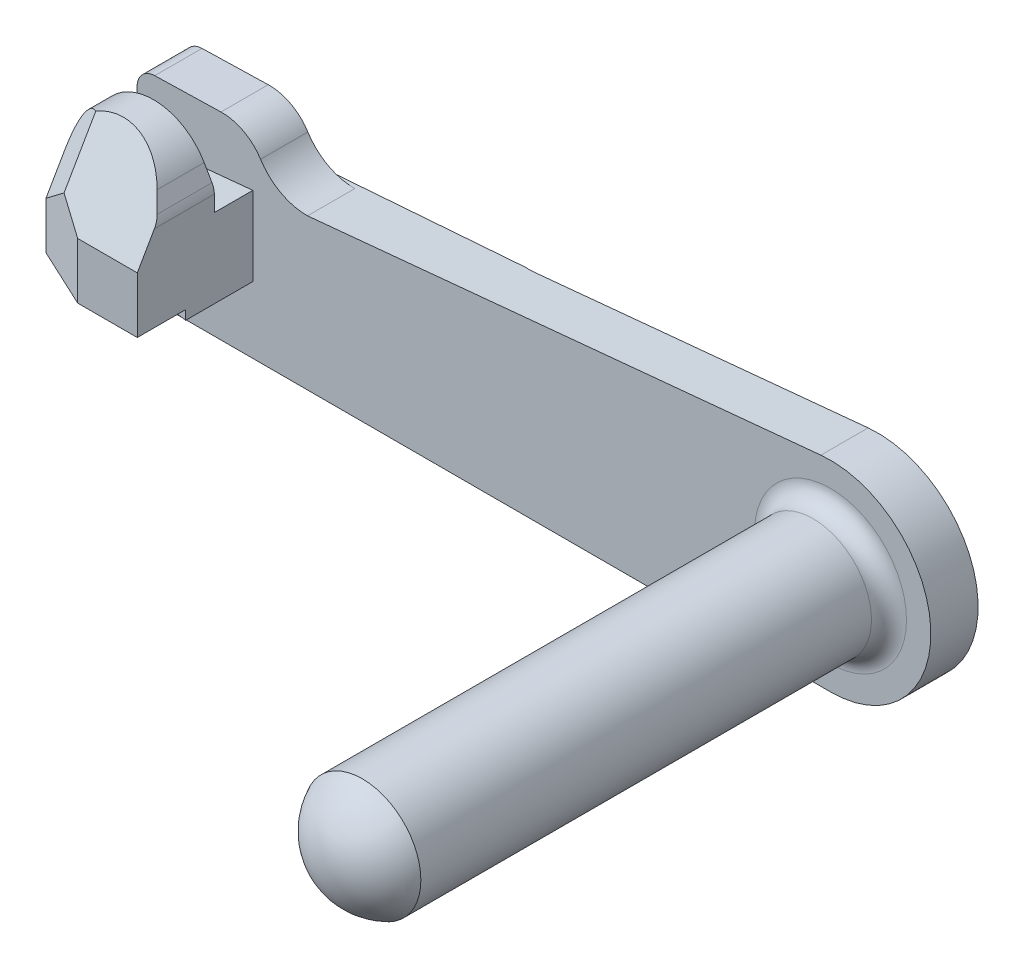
ISO-10303-21;
HEADER;
FILE_DESCRIPTION(('STEP AP214'),'2;1');
FILE_NAME('part.step','',(''),(''),'','','');
FILE_SCHEMA(('AUTOMOTIVE_DESIGN { 1 0 10303 214 1 1 1 1 }'));
ENDSEC;
DATA;
#1=APPLICATION_CONTEXT('core data for automotive mechanical design processes');
#2=APPLICATION_PROTOCOL_DEFINITION('international standard','automotive_design',2000,#1);
#3=PRODUCT_CONTEXT('',#1,'mechanical');
#4=PRODUCT('Part','Part','',(#3));
#5=PRODUCT_RELATED_PRODUCT_CATEGORY('part','',(#4));
#6=PRODUCT_DEFINITION_FORMATION('','',#4);
#7=PRODUCT_DEFINITION_CONTEXT('part definition',#1,'design');
#8=PRODUCT_DEFINITION('design','',#6,#7);
#9=PRODUCT_DEFINITION_SHAPE('','',#8);
#10=(LENGTH_UNIT() NAMED_UNIT(*) SI_UNIT(.MILLI.,.METRE.));
#11=(NAMED_UNIT(*) PLANE_ANGLE_UNIT() SI_UNIT($,.RADIAN.));
#12=(NAMED_UNIT(*) SI_UNIT($,.STERADIAN.) SOLID_ANGLE_UNIT());
#13=UNCERTAINTY_MEASURE_WITH_UNIT(LENGTH_MEASURE(1.E-05),#10,'distance_accuracy_value','');
#14=(GEOMETRIC_REPRESENTATION_CONTEXT(3) GLOBAL_UNCERTAINTY_ASSIGNED_CONTEXT((#13)) GLOBAL_UNIT_ASSIGNED_CONTEXT((#10,
#11,#12)) REPRESENTATION_CONTEXT('',''));
#15=CARTESIAN_POINT('',(0.,0.,0.));
#16=DIRECTION('',(0.,0.,1.));
#17=DIRECTION('',(1.,0.,0.));
#18=AXIS2_PLACEMENT_3D('',#15,#16,#17);
#19=CARTESIAN_POINT('',(-30.3276,-1.09799657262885,-3.06201057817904));
#20=CARTESIAN_POINT('',(-13.8176,-1.09799657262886,-3.06201057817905));
#21=CARTESIAN_POINT('',(-30.3276,-0.792923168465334,-2.52175810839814));
#22=CARTESIAN_POINT('',(-13.8176,-0.619080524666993,-2.34717611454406));
#23=CARTESIAN_POINT('',(-30.3276,-0.416160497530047,-2.01102980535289));
#24=CARTESIAN_POINT('',(-13.8176,-0.000810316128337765,-1.69415404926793));
#25=CARTESIAN_POINT('',(-30.3276,0.452593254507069,-1.09847239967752));
#26=CARTESIAN_POINT('',(-13.8176,1.42690286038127,-0.64239109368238));
#27=CARTESIAN_POINT('',(-30.3276,0.944185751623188,-0.697061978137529));
#28=CARTESIAN_POINT('',(-13.8176,2.23385034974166,-0.245488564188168));
#29=CARTESIAN_POINT('',(-30.3276,1.46879037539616,-0.365803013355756));
#30=CARTESIAN_POINT('',(-13.8176,3.05852256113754,0.));
#31=B_SPLINE_SURFACE_WITH_KNOTS('',3,1,((#19,#20),(#21,#22),(#23,#24),(#25,#26),(#27,#28),(#29,
#30)),.UNSPECIFIED.,.F.,.F.,.F.,(4,2,4),(2,2),(0.,0.5,1.),(0.,1.),.UNSPECIFIED.);
#32=CARTESIAN_POINT('',(-30.3276,-0.0898027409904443,-1.67063455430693));
#33=CARTESIAN_POINT('',(-29.4284240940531,-0.0763499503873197,-1.67318421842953));
#34=CARTESIAN_POINT('',(-28.5292319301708,-0.0640011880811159,-1.67552463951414));
#35=CARTESIAN_POINT('',(-26.7308260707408,-0.0411651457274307,-1.67985268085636));
#36=CARTESIAN_POINT('',(-25.8316123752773,-0.0306778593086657,-1.68184030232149));
#37=CARTESIAN_POINT('',(-23.6129855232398,-0.00667159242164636,-1.68639013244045));
#38=CARTESIAN_POINT('',(-22.2935627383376,0.00597417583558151,-1.68878684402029));
#39=CARTESIAN_POINT('',(-19.6546877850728,0.0287476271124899,-1.69310302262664));
#40=CARTESIAN_POINT('',(-18.3352356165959,0.0388752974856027,-1.69502248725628));
#41=CARTESIAN_POINT('',(-17.0157786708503,0.0481154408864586,-1.69677374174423));
#42=B_SPLINE_CURVE_WITH_KNOTS('',3,(#32,#33,#34,#35,#36,#37,#38,#39,#40,#41),.UNSPECIFIED.,.F.,
.F.,(4,2,2,2,4),(0.,2.69783851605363,5.39566779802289,9.35412158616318,13.312595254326),.UNSPECIFIED.);
#43=CARTESIAN_POINT('',(-30.3276,-0.0898308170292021,-1.6706292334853));
#44=VERTEX_POINT('',#43);
#45=CARTESIAN_POINT('',(-17.3317328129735,0.0458932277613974,-1.69635257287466));
#46=VERTEX_POINT('',#45);
#47=EDGE_CURVE('E486',#44,#46,#42,.T.);
#48=CARTESIAN_POINT('',(-30.3276,5.5372,-6.80881807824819));
#49=DIRECTION('',(1.,0.,0.));
#50=DIRECTION('',(0.,-1.,0.));
#51=AXIS2_PLACEMENT_3D('',#48,#49,#50);
#52=CIRCLE('',#51,7.62);
#53=CARTESIAN_POINT('',(-30.3276,0.276920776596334,-1.29576988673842));
#54=VERTEX_POINT('',#53);
#55=EDGE_CURVE('E186',#54,#44,#52,.T.);
#56=CARTESIAN_POINT('',(-16.4708589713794,0.312708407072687,-1.46431603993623));
#57=CARTESIAN_POINT('',(-17.3701092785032,0.311348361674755,-1.45791074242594));
#58=CARTESIAN_POINT('',(-18.2693564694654,0.309880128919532,-1.45099592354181));
#59=CARTESIAN_POINT('',(-20.0678424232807,0.306648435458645,-1.43577587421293));
#60=CARTESIAN_POINT('',(-20.967081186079,0.304884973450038,-1.42747063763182));
#61=CARTESIAN_POINT('',(-22.5714524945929,0.301404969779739,-1.41108114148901));
#62=CARTESIAN_POINT('',(-23.2765886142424,0.299760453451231,-1.40333609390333));
#63=CARTESIAN_POINT('',(-24.6868426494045,0.296185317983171,-1.38649856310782));
#64=CARTESIAN_POINT('',(-25.3919605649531,0.294254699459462,-1.37740608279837));
#65=CARTESIAN_POINT('',(-26.8021873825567,0.290036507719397,-1.35754000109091));
#66=CARTESIAN_POINT('',(-27.5072962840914,0.287748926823,-1.34676636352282));
#67=CARTESIAN_POINT('',(-28.9174788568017,0.282714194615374,-1.32305468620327));
#68=CARTESIAN_POINT('',(-29.6225525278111,0.27996704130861,-1.3101166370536));
#69=CARTESIAN_POINT('',(-30.3276,0.27693878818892,-1.2958547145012));
#70=B_SPLINE_CURVE_WITH_KNOTS('',3,(#56,#57,#58,#59,#60,#61,#62,#63,#64,#65,#66,#67,#68,#69),
.UNSPECIFIED.,.F.,.F.,(4,2,2,2,2,2,4),(0.,2.69782334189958,5.39565859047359,7.51119918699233,
9.62673522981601,11.742316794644,13.8579075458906),.UNSPECIFIED.);
#71=CARTESIAN_POINT('',(-17.0951732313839,0.311748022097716,-1.45979299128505));
#72=VERTEX_POINT('',#71);
#73=EDGE_CURVE('E507',#72,#54,#70,.T.);
#74=CARTESIAN_POINT('',(-18.6973908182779,-1.09799657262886,-3.06201057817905));
#75=CARTESIAN_POINT('',(-18.6086438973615,-1.04078273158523,-2.97326365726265));
#76=CARTESIAN_POINT('',(-18.5206695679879,-0.98120606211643,-2.88528932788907));
#77=CARTESIAN_POINT('',(-18.3463968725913,-0.857303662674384,-2.71101663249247));
#78=CARTESIAN_POINT('',(-18.2600987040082,-0.792977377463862,-2.62471846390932));
#79=CARTESIAN_POINT('',(-18.0035554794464,-0.592555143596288,-2.36817523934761));
#80=CARTESIAN_POINT('',(-17.8360685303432,-0.449277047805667,-2.20068829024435));
#81=CARTESIAN_POINT('',(-17.5274717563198,-0.159605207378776,-1.89209151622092));
#82=CARTESIAN_POINT('',(-17.3854485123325,-0.0151540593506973,-1.75006827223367));
#83=CARTESIAN_POINT('',(-17.110373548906,0.289457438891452,-1.47499330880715));
#84=CARTESIAN_POINT('',(-16.9773084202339,0.449593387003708,-1.34192818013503));
#85=CARTESIAN_POINT('',(-16.7286949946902,0.77733486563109,-1.09331475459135));
#86=CARTESIAN_POINT('',(-16.6125923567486,0.9440966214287,-0.977212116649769));
#87=CARTESIAN_POINT('',(-16.3914790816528,1.29175193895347,-0.756098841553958));
#88=CARTESIAN_POINT('',(-16.2864682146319,1.47264520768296,-0.651087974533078));
#89=CARTESIAN_POINT('',(-16.0880888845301,1.85017034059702,-0.452708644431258));
#90=CARTESIAN_POINT('',(-15.9948687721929,2.04695974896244,-0.359488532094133));
#91=CARTESIAN_POINT('',(-15.8664744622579,2.35189497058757,-0.231094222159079));
#92=CARTESIAN_POINT('',(-15.8255534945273,2.45525396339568,-0.190173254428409));
#93=CARTESIAN_POINT('',(-15.7478626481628,2.66508969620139,-0.112482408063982));
#94=CARTESIAN_POINT('',(-15.7110942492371,2.77156753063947,-0.0757140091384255));
#95=CARTESIAN_POINT('',(-15.6765683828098,2.87952426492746,-0.0411881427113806));
#96=B_SPLINE_CURVE_WITH_KNOTS('',3,(#74,#75,#76,#77,#78,#79,#80,#81,#82,#83,#84,#85,#86,#87,#88,
#89,#90,#91,#92,#93,#94,#95),.UNSPECIFIED.,.F.,.F.,(4,2,2,2,2,2,2,2,2,2,4),(0.,
0.413743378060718,0.827535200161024,1.65700938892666,2.39849827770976,3.13885136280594,
3.84002437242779,4.54118284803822,5.25043333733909,5.6056413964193,5.96097563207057),.UNSPECIFIED.);
#97=EDGE_CURVE('E831',#46,#72,#96,.T.);
#98=ORIENTED_EDGE('',*,*,#47,.F.);
#99=ORIENTED_EDGE('',*,*,#55,.F.);
#100=ORIENTED_EDGE('',*,*,#73,.F.);
#101=ORIENTED_EDGE('',*,*,#97,.F.);
#102=EDGE_LOOP('',(#98,#99,#100,#101));
#103=FACE_BOUND('',#102,.T.);
#104=ADVANCED_FACE('F181',(#103),#31,.T.);
#105=CARTESIAN_POINT('',(-30.3276,0.606926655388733,-0.999031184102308));
#106=CARTESIAN_POINT('',(-29.4286048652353,0.628875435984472,-1.00616800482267));
#107=CARTESIAN_POINT('',(-28.5295559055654,0.64871326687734,-1.01261843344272));
#108=CARTESIAN_POINT('',(-26.7313841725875,0.684824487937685,-1.02436028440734));
#109=CARTESIAN_POINT('',(-25.8322613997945,0.701097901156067,-1.0296517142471));
#110=CARTESIAN_POINT('',(-24.2279762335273,0.727540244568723,-1.03824965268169));
#111=CARTESIAN_POINT('',(-23.5228237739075,0.738268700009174,-1.0417380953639));
#112=CARTESIAN_POINT('',(-22.112493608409,0.758195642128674,-1.04821749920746));
#113=CARTESIAN_POINT('',(-21.4073159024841,0.767394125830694,-1.05120845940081));
#114=CARTESIAN_POINT('',(-19.9969309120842,0.784492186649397,-1.05676802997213));
#115=CARTESIAN_POINT('',(-19.2917236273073,0.792391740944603,-1.05933663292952));
#116=CARTESIAN_POINT('',(-17.8812986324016,0.807080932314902,-1.06411294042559));
#117=CARTESIAN_POINT('',(-17.1760809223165,0.813870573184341,-1.06632064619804));
#118=CARTESIAN_POINT('',(-16.4708589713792,0.820199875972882,-1.06837866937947));
#119=B_SPLINE_CURVE_WITH_KNOTS('',3,(#105,#106,#107,#108,#109,#110,#111,#112,#113,#114,#115,
#116,#117,#118),.UNSPECIFIED.,.F.,.F.,(4,2,2,2,2,2,4),(0.,2.69786682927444,5.39571621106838,
7.511442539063,9.62717298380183,11.7429405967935,13.8587009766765),.UNSPECIFIED.);
#120=CARTESIAN_POINT('',(-30.3276,0.606715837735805,-0.998962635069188));
#121=VERTEX_POINT('',#120);
#122=CARTESIAN_POINT('',(-16.7030762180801,0.818100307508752,-1.0676959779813));
#123=VERTEX_POINT('',#122);
#124=EDGE_CURVE('E509',#121,#123,#119,.T.);
#125=CARTESIAN_POINT('',(-30.3276,1.01798989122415,-0.673607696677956));
#126=VERTEX_POINT('',#125);
#127=EDGE_CURVE('E591',#126,#121,#52,.T.);
#128=CARTESIAN_POINT('',(-15.2343781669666,1.03906674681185,-0.929581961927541));
#129=CARTESIAN_POINT('',(-16.1336182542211,1.03845431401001,-0.92214408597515));
#130=CARTESIAN_POINT('',(-17.03285366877,1.03778143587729,-0.913972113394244));
#131=CARTESIAN_POINT('',(-18.8313152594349,1.03626617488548,-0.895569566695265));
#132=CARTESIAN_POINT('',(-19.7305414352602,1.03542378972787,-0.885338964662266));
#133=CARTESIAN_POINT('',(-21.4379947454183,1.03361716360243,-0.863397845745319));
#134=CARTESIAN_POINT('',(-22.2462250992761,1.03267387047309,-0.851941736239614));
#135=CARTESIAN_POINT('',(-23.8626363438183,1.03055979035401,-0.826266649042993));
#136=CARTESIAN_POINT('',(-24.6708172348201,1.02938900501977,-0.812047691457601));
#137=CARTESIAN_POINT('',(-26.2871666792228,1.02675235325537,-0.780026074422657));
#138=CARTESIAN_POINT('',(-27.0953352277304,1.02528646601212,-0.762223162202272));
#139=CARTESIAN_POINT('',(-28.3075055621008,1.02279645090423,-0.731982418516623));
#140=CARTESIAN_POINT('',(-28.7115517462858,1.02191790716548,-0.721312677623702));
#141=CARTESIAN_POINT('',(-29.5196066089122,1.02004829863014,-0.698606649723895));
#142=CARTESIAN_POINT('',(-29.9236152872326,1.01905723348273,-0.6865703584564));
#143=CARTESIAN_POINT('',(-30.3276,1.01800217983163,-0.673756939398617));
#144=B_SPLINE_CURVE_WITH_KNOTS('',3,(#128,#129,#130,#131,#132,#133,#134,#135,#136,#137,#138,
#139,#140,#141,#142,#143),.UNSPECIFIED.,.F.,.F.,(4,2,2,2,2,2,2,4),(0.,2.69781506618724,
5.39566671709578,7.82059920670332,10.245514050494,12.6705999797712,13.8831618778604,
15.0957275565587),.UNSPECIFIED.);
#145=CARTESIAN_POINT('',(-16.5535035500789,1.03812324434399,-0.918123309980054));
#146=VERTEX_POINT('',#145);
#147=EDGE_CURVE('E544',#146,#126,#144,.T.);
#148=EDGE_CURVE('E1597',#123,#146,#96,.T.);
#149=ORIENTED_EDGE('',*,*,#124,.F.);
#150=ORIENTED_EDGE('',*,*,#127,.F.);
#151=ORIENTED_EDGE('',*,*,#147,.F.);
#152=ORIENTED_EDGE('',*,*,#148,.F.);
#153=EDGE_LOOP('',(#149,#150,#151,#152));
#154=FACE_BOUND('',#153,.T.);
#155=ADVANCED_FACE('F1152',(#154),#31,.T.);
#156=CARTESIAN_POINT('',(-30.3276,1.38272734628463,-0.420969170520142));
#157=CARTESIAN_POINT('',(-29.4289025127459,1.41289963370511,-0.435226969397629));
#158=CARTESIAN_POINT('',(-28.5300819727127,1.43988148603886,-0.447977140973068));
#159=CARTESIAN_POINT('',(-26.7322769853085,1.48843180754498,-0.470919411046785));
#160=CARTESIAN_POINT('',(-25.8332925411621,1.51000037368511,-0.481111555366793));
#161=CARTESIAN_POINT('',(-24.1260705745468,1.54673742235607,-0.498471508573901));
#162=CARTESIAN_POINT('',(-23.3178439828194,1.56233242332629,-0.505840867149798));
#163=CARTESIAN_POINT('',(-21.7013218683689,1.59052983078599,-0.519165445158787));
#164=CARTESIAN_POINT('',(-20.8930263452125,1.60313221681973,-0.525120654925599));
#165=CARTESIAN_POINT('',(-19.276349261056,1.62587141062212,-0.535865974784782));
#166=CARTESIAN_POINT('',(-18.4679676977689,1.63600808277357,-0.540656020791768));
#167=CARTESIAN_POINT('',(-16.8511860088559,1.65423914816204,-0.549271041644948));
#168=CARTESIAN_POINT('',(-16.0427858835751,1.66233356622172,-0.553096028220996));
#169=CARTESIAN_POINT('',(-15.2343781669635,1.6696190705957,-0.556538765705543));
#170=B_SPLINE_CURVE_WITH_KNOTS('',3,(#156,#157,#158,#159,#160,#161,#162,#163,#164,#165,#166,
#167,#168,#169),.UNSPECIFIED.,.F.,.F.,(4,2,2,2,2,2,4),(0.,2.69793225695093,5.39581618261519,
7.82104082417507,10.2462820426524,12.6716566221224,15.0970017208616),.UNSPECIFIED.);
#171=CARTESIAN_POINT('',(-30.3276,1.3827208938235,-0.420966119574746));
#172=VERTEX_POINT('',#171);
#173=CARTESIAN_POINT('',(-16.1876788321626,1.66064603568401,-0.552298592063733));
#174=VERTEX_POINT('',#173);
#175=EDGE_CURVE('E1603',#172,#174,#170,.T.);
#176=CARTESIAN_POINT('',(-30.3276,1.45754949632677,-0.372914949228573));
#177=VERTEX_POINT('',#176);
#178=EDGE_CURVE('E583',#177,#172,#52,.T.);
#179=CARTESIAN_POINT('',(-30.3276,1.45754949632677,-0.372914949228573));
#180=CARTESIAN_POINT('',(-28.5378037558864,1.63011374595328,-0.332488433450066));
#181=CARTESIAN_POINT('',(-26.7480273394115,1.80288498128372,-0.292062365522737));
#182=CARTESIAN_POINT('',(-23.1014194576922,2.15555212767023,-0.209695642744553));
#183=CARTESIAN_POINT('',(-21.2445903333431,2.33547225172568,-0.167755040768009));
#184=CARTESIAN_POINT('',(-17.5310217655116,2.69624023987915,-0.0838758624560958));
#185=CARTESIAN_POINT('',(-15.6742823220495,2.87708810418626,-0.041937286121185));
#186=CARTESIAN_POINT('',(-13.8176,3.05852256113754,0.));
#187=B_SPLINE_CURVE_WITH_KNOTS('',3,(#179,#180,#181,#182,#183,#184,#185,#186),.UNSPECIFIED.,.F.,
.F.,(4,2,2,4),(0.,5.39565120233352,10.9936419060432,16.5916338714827),.UNSPECIFIED.);
#188=CARTESIAN_POINT('',(-15.3243973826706,2.91139261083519,-0.0340343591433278));
#189=VERTEX_POINT('',#188);
#190=EDGE_CURVE('E658',#177,#189,#187,.T.);
#191=CARTESIAN_POINT('',(-15.3243973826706,2.91139261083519,-0.0340343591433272));
#192=CARTESIAN_POINT('',(-15.3391677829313,2.90101318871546,-0.0372105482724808));
#193=CARTESIAN_POINT('',(-15.3536085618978,2.89022909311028,-0.0405431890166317));
#194=CARTESIAN_POINT('',(-15.3818757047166,2.86798712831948,-0.0474878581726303));
#195=CARTESIAN_POINT('',(-15.3957025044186,2.85652975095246,-0.0510996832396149));
#196=CARTESIAN_POINT('',(-15.4361887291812,2.82147581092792,-0.0622636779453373));
#197=CARTESIAN_POINT('',(-15.4620393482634,2.79706289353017,-0.0701853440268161));
#198=CARTESIAN_POINT('',(-15.5118996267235,2.74676943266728,-0.0868416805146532));
#199=CARTESIAN_POINT('',(-15.5359112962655,2.72089054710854,-0.0955754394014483));
#200=CARTESIAN_POINT('',(-15.5821231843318,2.66840312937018,-0.1136475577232));
#201=CARTESIAN_POINT('',(-15.6043428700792,2.64180842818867,-0.122976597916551));
#202=CARTESIAN_POINT('',(-15.6475578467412,2.58781164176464,-0.142289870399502));
#203=CARTESIAN_POINT('',(-15.6685513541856,2.56040846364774,-0.152275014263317));
#204=CARTESIAN_POINT('',(-15.7094559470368,2.50500735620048,-0.172852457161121));
#205=CARTESIAN_POINT('',(-15.7293664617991,2.47700912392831,-0.183445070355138));
#206=CARTESIAN_POINT('',(-15.7701022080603,2.41783417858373,-0.206258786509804));
#207=CARTESIAN_POINT('',(-15.7908290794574,2.38661239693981,-0.218538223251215));
#208=CARTESIAN_POINT('',(-15.8312302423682,2.32378762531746,-0.243754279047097));
#209=CARTESIAN_POINT('',(-15.8509051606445,2.29218487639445,-0.256690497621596));
#210=CARTESIAN_POINT('',(-15.8893045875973,2.22868319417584,-0.283207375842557));
#211=CARTESIAN_POINT('',(-15.9080292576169,2.19678431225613,-0.296787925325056));
#212=CARTESIAN_POINT('',(-15.9448713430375,2.13228443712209,-0.324790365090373));
#213=CARTESIAN_POINT('',(-15.9629755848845,2.09968005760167,-0.339221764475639));
#214=CARTESIAN_POINT('',(-15.9983331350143,2.03429667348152,-0.368731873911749));
#215=CARTESIAN_POINT('',(-16.0155863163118,2.00151764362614,-0.383810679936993));
#216=CARTESIAN_POINT('',(-16.0492740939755,1.93583521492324,-0.414610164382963));
#217=CARTESIAN_POINT('',(-16.0657086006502,1.90293180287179,-0.43033091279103));
#218=CARTESIAN_POINT('',(-16.0817495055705,1.86999251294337,-0.446369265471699));
#219=B_SPLINE_CURVE_WITH_KNOTS('',3,(#191,#192,#193,#194,#195,#196,#197,#198,#199,#200,#201,
#202,#203,#204,#205,#206,#207,#208,#209,#210,#211,#212,#213,#214,#215,#216,#217,#218),
.UNSPECIFIED.,.F.,.F.,(4,2,2,2,2,2,2,2,2,2,2,2,2,4),(0.,0.0549673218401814,0.109894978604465,
0.219055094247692,0.328094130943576,0.435717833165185,0.543494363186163,0.651327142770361,
0.76961053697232,0.88782265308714,1.00601463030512,1.12596446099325,1.24593213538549,
1.3659129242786),.UNSPECIFIED.);
#220=CARTESIAN_POINT('',(-16.0817495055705,1.86999251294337,-0.446369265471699));
#221=VERTEX_POINT('',#220);
#222=EDGE_CURVE('E743',#189,#221,#219,.T.);
#223=EDGE_CURVE('E1054',#174,#221,#96,.T.);
#224=ORIENTED_EDGE('',*,*,#175,.F.);
#225=ORIENTED_EDGE('',*,*,#178,.F.);
#226=ORIENTED_EDGE('',*,*,#190,.T.);
#227=ORIENTED_EDGE('',*,*,#222,.T.);
#228=ORIENTED_EDGE('',*,*,#223,.F.);
#229=EDGE_LOOP('',(#224,#225,#226,#227,#228));
#230=FACE_BOUND('',#229,.T.);
#231=ADVANCED_FACE('F1053',(#230),#31,.T.);
#232=CARTESIAN_POINT('',(-7.81769012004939,0.,7.81769012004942));
#233=DIRECTION('',(-0.707106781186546,0.,0.707106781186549));
#234=DIRECTION('',(0.707106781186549,0.,0.707106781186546));
#235=AXIS2_PLACEMENT_3D('',#232,#233,#234);
#236=PLANE('',#235);
#237=DIRECTION('',(0.,-1.,0.));
#238=VECTOR('',#237,1.);
#239=CARTESIAN_POINT('',(-16.0817495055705,-4.36880000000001,-0.446369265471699));
#240=LINE('',#239,#238);
#241=CARTESIAN_POINT('',(-16.0817495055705,1.43647890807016,-0.446369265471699));
#242=VERTEX_POINT('',#241);
#243=EDGE_CURVE('E809',#221,#242,#240,.T.);
#244=ORIENTED_EDGE('',*,*,#243,.T.);
#245=DIRECTION('',(-0.392889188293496,0.831430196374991,-0.392889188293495));
#246=VECTOR('',#245,1.);
#247=CARTESIAN_POINT('',(-13.0611973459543,-4.95559893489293,2.57418289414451));
#248=LINE('',#247,#246);
#249=EDGE_CURVE('E550',#242,#174,#248,.T.);
#250=ORIENTED_EDGE('',*,*,#249,.T.);
#251=ORIENTED_EDGE('',*,*,#223,.T.);
#252=EDGE_LOOP('',(#244,#250,#251));
#253=FACE_BOUND('',#252,.T.);
#254=ADVANCED_FACE('F817',(#253),#236,.F.);
#255=CARTESIAN_POINT('',(-17.0157786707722,-0.347650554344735,-2.09745334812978));
#256=CARTESIAN_POINT('',(-17.9150449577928,-0.349051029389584,-2.09344709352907));
#257=CARTESIAN_POINT('',(-18.8143099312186,-0.35054656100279,-2.0891689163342));
#258=CARTESIAN_POINT('',(-20.6128342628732,-0.353784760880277,-2.07990559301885));
#259=CARTESIAN_POINT('',(-21.5120936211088,-0.355527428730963,-2.07492044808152));
#260=CARTESIAN_POINT('',(-23.7307437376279,-0.360202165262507,-2.06154771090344));
#261=CARTESIAN_POINT('',(-25.0501312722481,-0.36330953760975,-2.05265863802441));
#262=CARTESIAN_POINT('',(-27.0291966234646,-0.368678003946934,-2.03730138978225));
#263=CARTESIAN_POINT('',(-27.6888832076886,-0.370585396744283,-2.03184502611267));
#264=CARTESIAN_POINT('',(-29.0082483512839,-0.37469243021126,-2.02009628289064));
#265=CARTESIAN_POINT('',(-29.6679269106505,-0.37689207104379,-2.0138039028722));
#266=CARTESIAN_POINT('',(-30.3276,-0.379266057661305,-2.00701278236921));
#267=B_SPLINE_CURVE_WITH_KNOTS('',3,(#255,#256,#257,#258,#259,#260,#261,#262,#263,#264,#265,
#266),.UNSPECIFIED.,.F.,.F.,(4,2,2,2,2,4),(0.,2.69782887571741,5.39565323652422,
9.35391412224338,11.3330493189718,13.3121856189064),.UNSPECIFIED.);
#268=CARTESIAN_POINT('',(-17.7295975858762,-0.348781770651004,-2.09421734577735));
#269=VERTEX_POINT('',#268);
#270=CARTESIAN_POINT('',(-30.3276,-0.379330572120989,-2.00682822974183));
#271=VERTEX_POINT('',#270);
#272=EDGE_CURVE('E466',#269,#271,#267,.T.);
#273=CARTESIAN_POINT('',(-18.064011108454,-0.638024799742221,-2.42863086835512));
#274=VERTEX_POINT('',#273);
#275=EDGE_CURVE('E830',#274,#269,#96,.T.);
#276=CARTESIAN_POINT('',(-30.3276,-0.695373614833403,-2.42517224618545));
#277=CARTESIAN_POINT('',(-29.428341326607,-0.689861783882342,-2.42550465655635));
#278=CARTESIAN_POINT('',(-28.5290805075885,-0.684712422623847,-2.42581520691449));
#279=CARTESIAN_POINT('',(-26.7305556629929,-0.675033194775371,-2.42639894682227));
#280=CARTESIAN_POINT('',(-25.8312916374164,-0.670503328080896,-2.42667213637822));
#281=CARTESIAN_POINT('',(-23.3157581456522,-0.658550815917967,-2.42739297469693));
#282=CARTESIAN_POINT('',(-21.6994859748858,-0.651701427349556,-2.42780605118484));
#283=CARTESIAN_POINT('',(-18.4669355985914,-0.639268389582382,-2.4285558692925));
#284=CARTESIAN_POINT('',(-16.8506573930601,-0.633684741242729,-2.42889261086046));
#285=CARTESIAN_POINT('',(-15.2343781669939,-0.628536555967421,-2.42920309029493));
#286=B_SPLINE_CURVE_WITH_KNOTS('',3,(#276,#277,#278,#279,#280,#281,#282,#283,#284,#285),
.UNSPECIFIED.,.F.,.F.,(4,2,2,2,4),(0.,2.69782668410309,5.39565291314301,10.2445125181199,
15.0933754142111),.UNSPECIFIED.);
#287=CARTESIAN_POINT('',(-30.3276,-0.695597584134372,-2.42515873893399));
#288=VERTEX_POINT('',#287);
#289=EDGE_CURVE('E1598',#288,#274,#286,.T.);
#290=EDGE_CURVE('E712',#271,#288,#52,.T.);
#291=ORIENTED_EDGE('',*,*,#272,.F.);
#292=ORIENTED_EDGE('',*,*,#275,.F.);
#293=ORIENTED_EDGE('',*,*,#289,.F.);
#294=ORIENTED_EDGE('',*,*,#290,.F.);
#295=EDGE_LOOP('',(#291,#292,#293,#294));
#296=FACE_BOUND('',#295,.T.);
#297=ADVANCED_FACE('F1157',(#296),#31,.T.);
#298=CARTESIAN_POINT('',(-0.418730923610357,4.34868691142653,2.0574));
#299=DIRECTION('',(0.0958457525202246,-0.995396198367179,0.));
#300=DIRECTION('',(0.995396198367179,0.0958457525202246,0.));
#301=AXIS2_PLACEMENT_3D('',#298,#299,#300);
#302=PLANE('',#301);
#303=DIRECTION('',(0.,0.,-1.));
#304=VECTOR('',#303,1.);
#305=CARTESIAN_POINT('',(-25.146,1.96772170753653,7.0866));
#306=LINE('',#305,#304);
#307=CARTESIAN_POINT('',(-25.146,1.96772170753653,3.7338));
#308=VERTEX_POINT('',#307);
#309=CARTESIAN_POINT('',(-25.145999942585,1.96772171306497,2.0574));
#310=VERTEX_POINT('',#309);
#311=EDGE_CURVE('E928',#308,#310,#306,.T.);
#312=ORIENTED_EDGE('',*,*,#311,.T.);
#313=DIRECTION('',(-0.995396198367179,-0.0958457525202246,0.));
#314=VECTOR('',#313,1.);
#315=CARTESIAN_POINT('',(-0.418730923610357,4.34868691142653,2.0574));
#316=LINE('',#315,#314);
#317=CARTESIAN_POINT('',(-30.3276,1.46879037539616,2.0574));
#318=VERTEX_POINT('',#317);
#319=EDGE_CURVE('E807',#310,#318,#316,.T.);
#320=ORIENTED_EDGE('',*,*,#319,.T.);
#321=DIRECTION('',(0.,0.,-1.));
#322=VECTOR('',#321,1.);
#323=CARTESIAN_POINT('',(-30.3276,1.46879037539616,2.0574));
#324=LINE('',#323,#322);
#325=CARTESIAN_POINT('',(-30.3276,1.46879037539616,3.7338));
#326=VERTEX_POINT('',#325);
#327=EDGE_CURVE('E993',#326,#318,#324,.T.);
#328=ORIENTED_EDGE('',*,*,#327,.F.);
#329=DIRECTION('',(-0.995396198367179,-0.0958457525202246,0.));
#330=VECTOR('',#329,1.);
#331=CARTESIAN_POINT('',(-20.2649407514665,2.43771425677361,3.7338));
#332=LINE('',#331,#330);
#333=EDGE_CURVE('E925',#308,#326,#332,.T.);
#334=ORIENTED_EDGE('',*,*,#333,.F.);
#335=EDGE_LOOP('',(#312,#320,#328,#334));
#336=FACE_BOUND('',#335,.T.);
#337=ADVANCED_FACE('F1121',(#336),#302,.F.);
#338=CARTESIAN_POINT('',(-13.8176,3.05852256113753,0.));
#339=DIRECTION('',(0.0225814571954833,0.,-0.999745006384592));
#340=DIRECTION('',(-0.999745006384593,0.,-0.0225814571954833));
#341=AXIS2_PLACEMENT_3D('',#338,#339,#340);
#342=PLANE('',#341);
#343=DIRECTION('',(0.995144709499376,0.0958215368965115,0.0224775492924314));
#344=VECTOR('',#343,1.);
#345=CARTESIAN_POINT('',(-30.3276,1.46879037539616,-0.372914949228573));
#346=LINE('',#345,#344);
#347=CARTESIAN_POINT('',(-30.3276,1.46879037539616,-0.372914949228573));
#348=VERTEX_POINT('',#347);
#349=CARTESIAN_POINT('',(-15.3243973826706,2.91343447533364,-0.0340343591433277));
#350=VERTEX_POINT('',#349);
#351=EDGE_CURVE('E656',#348,#350,#346,.T.);
#352=ORIENTED_EDGE('',*,*,#351,.T.);
#353=DIRECTION('',(0.,1.,0.));
#354=VECTOR('',#353,1.);
#355=CARTESIAN_POINT('',(-15.3243973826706,2.91343447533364,-0.0340343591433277));
#356=LINE('',#355,#354);
#357=EDGE_CURVE('E1045',#350,#189,#356,.F.);
#358=ORIENTED_EDGE('',*,*,#357,.T.);
#359=ORIENTED_EDGE('',*,*,#190,.F.);
#360=DIRECTION('',(0.,-1.,0.));
#361=VECTOR('',#360,1.);
#362=CARTESIAN_POINT('',(-30.3276,-4.3688,-0.372914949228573));
#363=LINE('',#362,#361);
#364=EDGE_CURVE('E586',#348,#177,#363,.T.);
#365=ORIENTED_EDGE('',*,*,#364,.F.);
#366=EDGE_LOOP('',(#352,#358,#359,#365));
#367=FACE_BOUND('',#366,.T.);
#368=ADVANCED_FACE('F615',(#367),#342,.T.);
#369=CARTESIAN_POINT('',(-30.3276,1.46879037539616,2.0574));
#370=DIRECTION('',(1.,0.,0.));
#371=DIRECTION('',(0.,1.,0.));
#372=AXIS2_PLACEMENT_3D('',#369,#370,#371);
#373=PLANE('',#372);
#374=ORIENTED_EDGE('',*,*,#55,.T.);
#375=DIRECTION('',(0.,0.982509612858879,-0.186211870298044));
#376=VECTOR('',#375,1.);
#377=CARTESIAN_POINT('',(-30.3276,-9.79469788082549,0.168702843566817));
#378=LINE('',#377,#376);
#379=CARTESIAN_POINT('',(-30.3276,-0.525736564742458,-1.58801342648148));
#380=VERTEX_POINT('',#379);
#381=EDGE_CURVE('E458',#380,#44,#378,.T.);
#382=ORIENTED_EDGE('',*,*,#381,.F.);
#383=DIRECTION('',(0.,-0.329990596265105,0.943984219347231));
#384=VECTOR('',#383,1.);
#385=CARTESIAN_POINT('',(-30.3276,-2.24584737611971,3.33260394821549));
#386=LINE('',#385,#384);
#387=EDGE_CURVE('E463',#271,#380,#386,.T.);
#388=ORIENTED_EDGE('',*,*,#387,.F.);
#389=ORIENTED_EDGE('',*,*,#290,.T.);
#390=DIRECTION('',(0.,0.998186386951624,-0.060199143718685));
#391=VECTOR('',#390,1.);
#392=CARTESIAN_POINT('',(-30.3276,-9.84519399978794,-1.87336012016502));
#393=LINE('',#392,#391);
#394=CARTESIAN_POINT('',(-30.3276,-1.13847593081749,-2.39844940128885));
#395=VERTEX_POINT('',#394);
#396=EDGE_CURVE('E1599',#395,#288,#393,.T.);
#397=ORIENTED_EDGE('',*,*,#396,.F.);
#398=DIRECTION('',(0.,-0.446959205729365,0.89455434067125));
#399=VECTOR('',#398,1.);
#400=CARTESIAN_POINT('',(-30.3276,-4.09770317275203,3.52421544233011));
#401=LINE('',#400,#399);
#402=CARTESIAN_POINT('',(-30.3276,-0.940166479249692,-2.79535045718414));
#403=VERTEX_POINT('',#402);
#404=EDGE_CURVE('E1602',#403,#395,#401,.T.);
#405=ORIENTED_EDGE('',*,*,#404,.F.);
#406=CARTESIAN_POINT('',(-30.3276,-1.09799657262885,-3.06201057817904));
#407=VERTEX_POINT('',#406);
#408=EDGE_CURVE('E702',#403,#407,#52,.T.);
#409=ORIENTED_EDGE('',*,*,#408,.T.);
#410=CARTESIAN_POINT('',(-30.3276,0.2032,1.84851764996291));
#411=DIRECTION('',(-1.,0.,0.));
#412=DIRECTION('',(0.,-1.,0.));
#413=AXIS2_PLACEMENT_3D('',#410,#411,#412);
#414=CIRCLE('',#413,5.08);
#415=CARTESIAN_POINT('',(-30.3276,-4.36534798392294,-0.372914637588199));
#416=VERTEX_POINT('',#415);
#417=EDGE_CURVE('E590',#407,#416,#414,.T.);
#418=ORIENTED_EDGE('',*,*,#417,.T.);
#419=CARTESIAN_POINT('',(-30.3276,-4.3688,-0.372914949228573));
#420=VERTEX_POINT('',#419);
#421=EDGE_CURVE('E659',#416,#420,#363,.T.);
#422=ORIENTED_EDGE('',*,*,#421,.T.);
#423=DIRECTION('',(0.,0.,1.));
#424=VECTOR('',#423,1.);
#425=CARTESIAN_POINT('',(-30.3276,-4.3688,0.));
#426=LINE('',#425,#424);
#427=CARTESIAN_POINT('',(-30.3276,-4.3688,0.));
#428=VERTEX_POINT('',#427);
#429=EDGE_CURVE('E651',#420,#428,#426,.T.);
#430=ORIENTED_EDGE('',*,*,#429,.T.);
#431=DIRECTION('',(0.,0.,-1.));
#432=VECTOR('',#431,1.);
#433=CARTESIAN_POINT('',(-30.3276,-4.3688,2.0574));
#434=LINE('',#433,#432);
#435=CARTESIAN_POINT('',(-30.3276,-4.3688,2.0574));
#436=VERTEX_POINT('',#435);
#437=EDGE_CURVE('E1014',#436,#428,#434,.T.);
#438=ORIENTED_EDGE('',*,*,#437,.F.);
#439=DIRECTION('',(0.,-1.,0.));
#440=VECTOR('',#439,1.);
#441=CARTESIAN_POINT('',(-30.3276,1.46879037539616,2.0574));
#442=LINE('',#441,#440);
#443=CARTESIAN_POINT('',(-30.3276,-1.74223930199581,2.0574));
#444=VERTEX_POINT('',#443);
#445=EDGE_CURVE('E981',#444,#436,#442,.T.);
#446=ORIENTED_EDGE('',*,*,#445,.F.);
#447=DIRECTION('',(0.,0.,-1.));
#448=VECTOR('',#447,1.);
#449=CARTESIAN_POINT('',(-30.3276,-1.74223930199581,7.0866));
#450=LINE('',#449,#448);
#451=CARTESIAN_POINT('',(-30.3276,-1.74223930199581,4.06474411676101));
#452=VERTEX_POINT('',#451);
#453=EDGE_CURVE('E972',#452,#444,#450,.T.);
#454=ORIENTED_EDGE('',*,*,#453,.F.);
#455=DIRECTION('',(0.,1.,0.));
#456=VECTOR('',#455,1.);
#457=CARTESIAN_POINT('',(-30.3276,-11.176,4.06474411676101));
#458=LINE('',#457,#456);
#459=CARTESIAN_POINT('',(-30.3276,-1.0668,4.06474411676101));
#460=VERTEX_POINT('',#459);
#461=EDGE_CURVE('E919',#452,#460,#458,.T.);
#462=ORIENTED_EDGE('',*,*,#461,.T.);
#463=DIRECTION('',(0.,0.,-1.));
#464=VECTOR('',#463,1.);
#465=CARTESIAN_POINT('',(-30.3276,-1.0668,7.0866));
#466=LINE('',#465,#464);
#467=CARTESIAN_POINT('',(-30.3276,-1.0668,5.87904090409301));
#468=VERTEX_POINT('',#467);
#469=EDGE_CURVE('E908',#468,#460,#466,.T.);
#470=ORIENTED_EDGE('',*,*,#469,.F.);
#471=DIRECTION('',(0.,-1.,0.));
#472=VECTOR('',#471,1.);
#473=CARTESIAN_POINT('',(-30.3276,4.9022,5.87904090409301));
#474=LINE('',#473,#472);
#475=CARTESIAN_POINT('',(-30.3276,0.990830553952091,5.87904090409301));
#476=VERTEX_POINT('',#475);
#477=EDGE_CURVE('E951',#476,#468,#474,.T.);
#478=ORIENTED_EDGE('',*,*,#477,.F.);
#479=DIRECTION('',(0.,0.866025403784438,-0.5));
#480=VECTOR('',#479,1.);
#481=CARTESIAN_POINT('',(-30.3276,-2.46273028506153,7.87295518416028));
#482=LINE('',#481,#480);
#483=CARTESIAN_POINT('',(-30.3276,2.3622,5.08728038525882));
#484=VERTEX_POINT('',#483);
#485=EDGE_CURVE('E686',#476,#484,#482,.T.);
#486=ORIENTED_EDGE('',*,*,#485,.T.);
#487=DIRECTION('',(0.,0.,-1.));
#488=VECTOR('',#487,1.);
#489=CARTESIAN_POINT('',(-30.3276,2.3622,7.0866));
#490=LINE('',#489,#488);
#491=CARTESIAN_POINT('',(-30.3276,2.3622,3.7338));
#492=VERTEX_POINT('',#491);
#493=EDGE_CURVE('E973',#484,#492,#490,.T.);
#494=ORIENTED_EDGE('',*,*,#493,.T.);
#495=DIRECTION('',(0.,-1.,0.));
#496=VECTOR('',#495,1.);
#497=CARTESIAN_POINT('',(-30.3276,-11.1145802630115,3.7338));
#498=LINE('',#497,#496);
#499=EDGE_CURVE('E922',#492,#326,#498,.T.);
#500=ORIENTED_EDGE('',*,*,#499,.T.);
#501=ORIENTED_EDGE('',*,*,#327,.T.);
#502=DIRECTION('',(0.,0.,-1.));
#503=VECTOR('',#502,1.);
#504=CARTESIAN_POINT('',(-30.3276,1.46879037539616,10.2962476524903));
#505=LINE('',#504,#503);
#506=CARTESIAN_POINT('',(-30.3276,1.46879037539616,0.));
#507=VERTEX_POINT('',#506);
#508=EDGE_CURVE('E646',#318,#507,#505,.T.);
#509=ORIENTED_EDGE('',*,*,#508,.T.);
#510=DIRECTION('',(0.,0.,-1.));
#511=VECTOR('',#510,1.);
#512=CARTESIAN_POINT('',(-30.3276,1.46879037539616,-0.372914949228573));
#513=LINE('',#512,#511);
#514=EDGE_CURVE('E643',#507,#348,#513,.T.);
#515=ORIENTED_EDGE('',*,*,#514,.T.);
#516=ORIENTED_EDGE('',*,*,#364,.T.);
#517=ORIENTED_EDGE('',*,*,#178,.T.);
#518=DIRECTION('',(0.,0.904135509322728,-0.427245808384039));
#519=VECTOR('',#518,1.);
#520=CARTESIAN_POINT('',(-30.3276,-8.11225447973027,4.06584850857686));
#521=LINE('',#520,#519);
#522=CARTESIAN_POINT('',(-30.3276,0.981579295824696,-0.231408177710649));
#523=VERTEX_POINT('',#522);
#524=EDGE_CURVE('E546',#523,#172,#521,.T.);
#525=ORIENTED_EDGE('',*,*,#524,.F.);
#526=DIRECTION('',(0.,-0.0820620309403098,0.996627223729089));
#527=VECTOR('',#526,1.);
#528=CARTESIAN_POINT('',(-30.3276,0.831017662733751,1.59713323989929));
#529=LINE('',#528,#527);
#530=EDGE_CURVE('E549',#126,#523,#529,.T.);
#531=ORIENTED_EDGE('',*,*,#530,.F.);
#532=ORIENTED_EDGE('',*,*,#127,.T.);
#533=DIRECTION('',(0.,0.950989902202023,-0.309221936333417));
#534=VECTOR('',#533,1.);
#535=CARTESIAN_POINT('',(-30.3276,-9.21247657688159,2.19382593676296));
#536=LINE('',#535,#534);
#537=CARTESIAN_POINT('',(-30.3276,0.184767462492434,-0.861762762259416));
#538=VERTEX_POINT('',#537);
#539=EDGE_CURVE('E491',#538,#121,#536,.T.);
#540=ORIENTED_EDGE('',*,*,#539,.F.);
#541=DIRECTION('',(0.,-0.207700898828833,0.978192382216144));
#542=VECTOR('',#541,1.);
#543=CARTESIAN_POINT('',(-30.3276,-0.564747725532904,2.6681692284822));
#544=LINE('',#543,#542);
#545=EDGE_CURVE('E494',#54,#538,#544,.T.);
#546=ORIENTED_EDGE('',*,*,#545,.F.);
#547=EDGE_LOOP('',(#374,#382,#388,#389,#397,#405,#409,#418,#422,#430,#438,#446,#454,#462,#470,
#478,#486,#494,#500,#501,#509,#515,#516,#517,#525,#531,#532,#540,#546));
#548=FACE_BOUND('',#547,.T.);
#549=ADVANCED_FACE('F471',(#548),#373,.F.);
#550=CARTESIAN_POINT('',(-25.146,-1.4706831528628,7.0866));
#551=DIRECTION('',(-1.,0.,0.));
#552=DIRECTION('',(0.,0.,1.));
#553=AXIS2_PLACEMENT_3D('',#550,#551,#552);
#554=PLANE('',#553);
#555=DIRECTION('',(0.,1.,0.));
#556=VECTOR('',#555,1.);
#557=CARTESIAN_POINT('',(-25.146,-11.176,4.9784));
#558=LINE('',#557,#556);
#559=CARTESIAN_POINT('',(-25.146,-1.4706831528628,4.9784));
#560=VERTEX_POINT('',#559);
#561=CARTESIAN_POINT('',(-25.146,-1.0668,4.9784));
#562=VERTEX_POINT('',#561);
#563=EDGE_CURVE('E917',#560,#562,#558,.T.);
#564=ORIENTED_EDGE('',*,*,#563,.F.);
#565=DIRECTION('',(0.,0.,-1.));
#566=VECTOR('',#565,1.);
#567=CARTESIAN_POINT('',(-25.146,-1.4706831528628,7.0866));
#568=LINE('',#567,#566);
#569=CARTESIAN_POINT('',(-25.146,-1.4706831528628,2.0574));
#570=VERTEX_POINT('',#569);
#571=EDGE_CURVE('E970',#560,#570,#568,.T.);
#572=ORIENTED_EDGE('',*,*,#571,.T.);
#573=DIRECTION('',(0.,1.,0.));
#574=VECTOR('',#573,1.);
#575=CARTESIAN_POINT('',(-25.146,-1.4706831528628,2.0574));
#576=LINE('',#575,#574);
#577=EDGE_CURVE('E960',#570,#310,#576,.T.);
#578=ORIENTED_EDGE('',*,*,#577,.T.);
#579=ORIENTED_EDGE('',*,*,#311,.F.);
#580=DIRECTION('',(0.,-1.,0.));
#581=VECTOR('',#580,1.);
#582=CARTESIAN_POINT('',(-25.146,-1.4706831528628,3.7338));
#583=LINE('',#582,#581);
#584=CARTESIAN_POINT('',(-25.146,2.66263730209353,3.7338));
#585=VERTEX_POINT('',#584);
#586=EDGE_CURVE('E933',#585,#308,#583,.T.);
#587=ORIENTED_EDGE('',*,*,#586,.F.);
#588=DIRECTION('',(0.,0.,-1.));
#589=VECTOR('',#588,1.);
#590=CARTESIAN_POINT('',(-25.146,2.66263730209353,7.0866));
#591=LINE('',#590,#589);
#592=CARTESIAN_POINT('',(-25.146,2.66263730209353,6.34121926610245));
#593=VERTEX_POINT('',#592);
#594=EDGE_CURVE('E967',#593,#585,#591,.T.);
#595=ORIENTED_EDGE('',*,*,#594,.F.);
#596=DIRECTION('',(0.,-0.866025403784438,0.500000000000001));
#597=VECTOR('',#596,1.);
#598=CARTESIAN_POINT('',(-25.146,-0.760112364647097,8.31734470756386));
#599=LINE('',#598,#597);
#600=CARTESIAN_POINT('',(-25.146,1.3716,7.0866));
#601=VERTEX_POINT('',#600);
#602=EDGE_CURVE('E948',#593,#601,#599,.T.);
#603=ORIENTED_EDGE('',*,*,#602,.T.);
#604=DIRECTION('',(0.,1.,0.));
#605=VECTOR('',#604,1.);
#606=CARTESIAN_POINT('',(-25.146,-1.4706831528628,7.0866));
#607=LINE('',#606,#605);
#608=CARTESIAN_POINT('',(-25.146,-1.0668,7.0866));
#609=VERTEX_POINT('',#608);
#610=EDGE_CURVE('E957',#609,#601,#607,.T.);
#611=ORIENTED_EDGE('',*,*,#610,.F.);
#612=DIRECTION('',(0.,0.,1.));
#613=VECTOR('',#612,1.);
#614=CARTESIAN_POINT('',(-25.146,-1.0668,4.9784));
#615=LINE('',#614,#613);
#616=EDGE_CURVE('E913',#562,#609,#615,.T.);
#617=ORIENTED_EDGE('',*,*,#616,.F.);
#618=EDGE_LOOP('',(#564,#572,#578,#579,#587,#595,#603,#611,#617));
#619=FACE_BOUND('',#618,.T.);
#620=ADVANCED_FACE('F614',(#619),#554,.F.);
#621=CARTESIAN_POINT('',(-30.3276,-1.74223930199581,7.0866));
#622=DIRECTION('',(-0.0523359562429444,0.998629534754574,0.));
#623=DIRECTION('',(-0.998629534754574,-0.0523359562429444,0.));
#624=AXIS2_PLACEMENT_3D('',#621,#622,#623);
#625=PLANE('',#624);
#626=DIRECTION('',(0.983498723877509,0.0515429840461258,0.17341736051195));
#627=VECTOR('',#626,1.);
#628=CARTESIAN_POINT('',(-29.8122050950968,-1.71522859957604,4.15562214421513));
#629=LINE('',#628,#627);
#630=EDGE_CURVE('E1000',#452,#560,#629,.T.);
#631=ORIENTED_EDGE('',*,*,#630,.F.);
#632=ORIENTED_EDGE('',*,*,#453,.T.);
#633=DIRECTION('',(0.998629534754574,0.0523359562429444,0.));
#634=VECTOR('',#633,1.);
#635=CARTESIAN_POINT('',(-30.3276,-1.74223930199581,2.0574));
#636=LINE('',#635,#634);
#637=EDGE_CURVE('E956',#444,#570,#636,.T.);
#638=ORIENTED_EDGE('',*,*,#637,.T.);
#639=ORIENTED_EDGE('',*,*,#571,.F.);
#640=EDGE_LOOP('',(#631,#632,#638,#639));
#641=FACE_BOUND('',#640,.T.);
#642=ADVANCED_FACE('F1109',(#641),#625,.F.);
#643=CARTESIAN_POINT('',(-27.7876,2.3622,7.0866));
#644=DIRECTION('',(0.,0.,-1.));
#645=DIRECTION('',(-1.,0.,0.));
#646=AXIS2_PLACEMENT_3D('',#643,#644,#645);
#647=CYLINDRICAL_SURFACE('',#646,2.54);
#648=ORIENTED_EDGE('',*,*,#493,.F.);
#649=CARTESIAN_POINT('',(-27.7876,2.3622,7.54830872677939));
#650=DIRECTION('',(0.64278760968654,-0.383022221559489,-0.663413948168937));
#651=DIRECTION('',(-0.569906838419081,0.339594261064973,-0.748252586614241));
#652=AXIS2_PLACEMENT_3D('',#649,#650,#651);
#653=ELLIPSE('',#652,3.82868042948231,2.54);
#654=CARTESIAN_POINT('',(-28.8544,4.66731122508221,5.18382023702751));
#655=VERTEX_POINT('',#654);
#656=EDGE_CURVE('E905',#484,#655,#653,.T.);
#657=ORIENTED_EDGE('',*,*,#656,.T.);
#658=CARTESIAN_POINT('',(-27.7876,2.3622,6.51467682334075));
#659=DIRECTION('',(0.,-0.500000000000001,-0.866025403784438));
#660=DIRECTION('',(0.,0.866025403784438,-0.500000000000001));
#661=AXIS2_PLACEMENT_3D('',#658,#659,#660);
#662=ELLIPSE('',#661,2.9329393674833,2.54);
#663=CARTESIAN_POINT('',(-25.5878954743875,3.63219999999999,5.78144198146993));
#664=VERTEX_POINT('',#663);
#665=EDGE_CURVE('E940',#655,#664,#662,.T.);
#666=ORIENTED_EDGE('',*,*,#665,.T.);
#667=DIRECTION('',(0.,0.,-1.));
#668=VECTOR('',#667,1.);
#669=CARTESIAN_POINT('',(-25.5878954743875,3.63219999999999,7.0866));
#670=LINE('',#669,#668);
#671=CARTESIAN_POINT('',(-25.5878954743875,3.63219999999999,3.7338));
#672=VERTEX_POINT('',#671);
#673=EDGE_CURVE('E959',#664,#672,#670,.T.);
#674=ORIENTED_EDGE('',*,*,#673,.T.);
#675=CARTESIAN_POINT('',(-27.7876,2.3622,3.7338));
#676=DIRECTION('',(0.,0.,-1.));
#677=DIRECTION('',(0.,1.,0.));
#678=AXIS2_PLACEMENT_3D('',#675,#676,#677);
#679=CIRCLE('',#678,2.54);
#680=EDGE_CURVE('E935',#492,#672,#679,.T.);
#681=ORIENTED_EDGE('',*,*,#680,.F.);
#682=EDGE_LOOP('',(#648,#657,#666,#674,#681));
#683=FACE_BOUND('',#682,.T.);
#684=ADVANCED_FACE('F1138',(#683),#647,.T.);
#685=CARTESIAN_POINT('',(-25.908,2.66263730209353,7.0866));
#686=DIRECTION('',(0.,0.,-1.));
#687=DIRECTION('',(-1.,0.,0.));
#688=AXIS2_PLACEMENT_3D('',#685,#686,#687);
#689=CYLINDRICAL_SURFACE('',#688,0.761999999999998);
#690=CARTESIAN_POINT('',(-25.908,2.66263730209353,3.7338));
#691=DIRECTION('',(0.,0.,-1.));
#692=DIRECTION('',(0.,1.,0.));
#693=AXIS2_PLACEMENT_3D('',#690,#691,#692);
#694=CIRCLE('',#693,0.761999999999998);
#695=CARTESIAN_POINT('',(-25.2480886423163,3.04363730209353,3.7338));
#696=VERTEX_POINT('',#695);
#697=EDGE_CURVE('E931',#696,#585,#694,.T.);
#698=ORIENTED_EDGE('',*,*,#697,.F.);
#699=DIRECTION('',(0.,0.,-1.));
#700=VECTOR('',#699,1.);
#701=CARTESIAN_POINT('',(-25.2480886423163,3.04363730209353,7.0866));
#702=LINE('',#701,#700);
#703=CARTESIAN_POINT('',(-25.2480886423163,3.04363730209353,6.1212488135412));
#704=VERTEX_POINT('',#703);
#705=EDGE_CURVE('E964',#704,#696,#702,.T.);
#706=ORIENTED_EDGE('',*,*,#705,.F.);
#707=CARTESIAN_POINT('',(-25.908,2.66263730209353,6.34121926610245));
#708=DIRECTION('',(0.,-0.500000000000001,-0.866025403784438));
#709=DIRECTION('',(0.,0.866025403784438,-0.500000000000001));
#710=AXIS2_PLACEMENT_3D('',#707,#708,#709);
#711=ELLIPSE('',#710,0.879881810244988,0.761999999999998);
#712=EDGE_CURVE('E945',#704,#593,#711,.T.);
#713=ORIENTED_EDGE('',*,*,#712,.T.);
#714=ORIENTED_EDGE('',*,*,#594,.T.);
#715=EDGE_LOOP('',(#698,#706,#713,#714));
#716=FACE_BOUND('',#715,.T.);
#717=ADVANCED_FACE('F1125',(#716),#689,.T.);
#718=CARTESIAN_POINT('',(-25.5878954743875,3.63219999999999,7.0866));
#719=DIRECTION('',(-0.866025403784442,-0.499999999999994,0.));
#720=DIRECTION('',(0.499999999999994,-0.866025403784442,0.));
#721=AXIS2_PLACEMENT_3D('',#718,#719,#720);
#722=PLANE('',#721);
#723=DIRECTION('',(0.499999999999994,-0.866025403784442,0.));
#724=VECTOR('',#723,1.);
#725=CARTESIAN_POINT('',(-25.5878954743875,3.63219999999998,3.7338));
#726=LINE('',#725,#724);
#727=EDGE_CURVE('E1088',#672,#696,#726,.T.);
#728=ORIENTED_EDGE('',*,*,#727,.F.);
#729=ORIENTED_EDGE('',*,*,#673,.F.);
#730=DIRECTION('',(0.447213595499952,-0.774596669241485,0.44721359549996));
#731=VECTOR('',#730,1.);
#732=CARTESIAN_POINT('',(-25.3268638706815,3.18007999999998,6.04247358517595));
#733=LINE('',#732,#731);
#734=EDGE_CURVE('E942',#664,#704,#733,.T.);
#735=ORIENTED_EDGE('',*,*,#734,.T.);
#736=ORIENTED_EDGE('',*,*,#705,.T.);
#737=EDGE_LOOP('',(#728,#729,#735,#736));
#738=FACE_BOUND('',#737,.T.);
#739=ADVANCED_FACE('F1134',(#738),#722,.F.);
#740=CARTESIAN_POINT('',(0.,0.,2.0574));
#741=DIRECTION('',(0.,0.,1.));
#742=DIRECTION('',(1.,0.,0.));
#743=AXIS2_PLACEMENT_3D('',#740,#741,#742);
#744=PLANE('',#743);
#745=DIRECTION('',(-0.995396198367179,-0.0958457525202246,0.));
#746=VECTOR('',#745,1.);
#747=CARTESIAN_POINT('',(-0.418730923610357,4.34868691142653,2.0574));
#748=LINE('',#747,#746);
#749=CARTESIAN_POINT('',(-0.418730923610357,4.34868691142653,2.0574));
#750=VERTEX_POINT('',#749);
#751=CARTESIAN_POINT('',(-22.7643055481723,2.19705279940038,2.0574));
#752=VERTEX_POINT('',#751);
#753=EDGE_CURVE('E1025',#750,#752,#748,.T.);
#754=ORIENTED_EDGE('',*,*,#753,.T.);
#755=CARTESIAN_POINT('',(-22.7911527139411,4.58450185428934,2.0574));
#756=DIRECTION('',(0.,0.,1.));
#757=DIRECTION('',(1.,0.,0.));
#758=AXIS2_PLACEMENT_3D('',#755,#756,#757);
#759=CIRCLE('',#758,2.3876);
#760=CARTESIAN_POINT('',(-24.8085748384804,3.30753602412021,2.0574));
#761=VERTEX_POINT('',#760);
#762=EDGE_CURVE('E858',#761,#752,#759,.T.);
#763=ORIENTED_EDGE('',*,*,#762,.F.);
#764=CARTESIAN_POINT('',(-26.482605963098,2.24792607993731,2.0574));
#765=DIRECTION('',(0.,0.,1.));
#766=DIRECTION('',(1.,0.,0.));
#767=AXIS2_PLACEMENT_3D('',#764,#765,#766);
#768=CIRCLE('',#767,1.9812);
#769=CARTESIAN_POINT('',(-26.5322916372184,4.22850295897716,2.0574));
#770=VERTEX_POINT('',#769);
#771=EDGE_CURVE('E861',#770,#761,#768,.F.);
#772=ORIENTED_EDGE('',*,*,#771,.F.);
#773=DIRECTION('',(0.999685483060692,0.0250785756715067,0.));
#774=VECTOR('',#773,1.);
#775=CARTESIAN_POINT('',(-26.5322916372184,4.22850295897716,2.0574));
#776=LINE('',#775,#774);
#777=CARTESIAN_POINT('',(-29.4156857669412,4.15616879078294,2.0574));
#778=VERTEX_POINT('',#777);
#779=EDGE_CURVE('E865',#778,#770,#776,.T.);
#780=ORIENTED_EDGE('',*,*,#779,.F.);
#781=CARTESIAN_POINT('',(-29.3959388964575,3.36901644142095,2.0574));
#782=DIRECTION('',(0.,0.,1.));
#783=DIRECTION('',(1.,0.,0.));
#784=AXIS2_PLACEMENT_3D('',#781,#782,#783);
#785=CIRCLE('',#784,0.787400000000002);
#786=CARTESIAN_POINT('',(-30.182551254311,3.40422664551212,2.0574));
#787=VERTEX_POINT('',#786);
#788=EDGE_CURVE('E869',#787,#778,#785,.F.);
#789=ORIENTED_EDGE('',*,*,#788,.F.);
#790=DIRECTION('',(0.0447170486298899,0.998999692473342,0.));
#791=VECTOR('',#790,1.);
#792=CARTESIAN_POINT('',(-30.182551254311,3.40422664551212,2.0574));
#793=LINE('',#792,#791);
#794=CARTESIAN_POINT('',(-30.2559992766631,1.76336361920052,2.0574));
#795=VERTEX_POINT('',#794);
#796=EDGE_CURVE('E840',#795,#787,#793,.T.);
#797=ORIENTED_EDGE('',*,*,#796,.F.);
#798=CARTESIAN_POINT('',(-31.0426116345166,1.7985738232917,2.0574));
#799=DIRECTION('',(0.,0.,1.));
#800=DIRECTION('',(1.,0.,0.));
#801=AXIS2_PLACEMENT_3D('',#798,#799,#800);
#802=CIRCLE('',#801,0.787399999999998);
#803=EDGE_CURVE('E762',#318,#795,#802,.T.);
#804=ORIENTED_EDGE('',*,*,#803,.F.);
#805=ORIENTED_EDGE('',*,*,#319,.F.);
#806=ORIENTED_EDGE('',*,*,#577,.F.);
#807=ORIENTED_EDGE('',*,*,#637,.F.);
#808=ORIENTED_EDGE('',*,*,#445,.T.);
#809=DIRECTION('',(1.,0.,0.));
#810=VECTOR('',#809,1.);
#811=CARTESIAN_POINT('',(-30.3276,-4.3688,2.0574));
#812=LINE('',#811,#810);
#813=CARTESIAN_POINT('',(0.,-4.3688,2.0574));
#814=VERTEX_POINT('',#813);
#815=EDGE_CURVE('E978',#436,#814,#812,.T.);
#816=ORIENTED_EDGE('',*,*,#815,.T.);
#817=CARTESIAN_POINT('',(0.,0.,2.0574));
#818=DIRECTION('',(0.,0.,1.));
#819=DIRECTION('',(1.,0.,0.));
#820=AXIS2_PLACEMENT_3D('',#817,#818,#819);
#821=CIRCLE('',#820,4.3688);
#822=EDGE_CURVE('E1027',#814,#750,#821,.T.);
#823=ORIENTED_EDGE('',*,*,#822,.T.);
#824=EDGE_LOOP('',(#754,#763,#772,#780,#789,#797,#804,#805,#806,#807,#808,#816,#823));
#825=FACE_BOUND('',#824,.T.);
#826=CARTESIAN_POINT('',(0.,0.,2.0574));
#827=DIRECTION('',(0.,0.,1.));
#828=DIRECTION('',(1.,0.,0.));
#829=AXIS2_PLACEMENT_3D('',#826,#827,#828);
#830=CIRCLE('',#829,3.30835);
#831=CARTESIAN_POINT('',(3.30835,0.,2.0574));
#832=VERTEX_POINT('',#831);
#833=EDGE_CURVE('E1005',#832,#832,#830,.F.);
#834=ORIENTED_EDGE('',*,*,#833,.T.);
#835=EDGE_LOOP('',(#834));
#836=FACE_BOUND('',#835,.T.);
#837=ADVANCED_FACE('F1116',(#825,#836),#744,.T.);
#838=CARTESIAN_POINT('',(-30.3276,-4.3688,2.0574));
#839=DIRECTION('',(0.,1.,0.));
#840=DIRECTION('',(-1.,0.,0.));
#841=AXIS2_PLACEMENT_3D('',#838,#839,#840);
#842=PLANE('',#841);
#843=DIRECTION('',(0.999745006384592,0.,0.0225814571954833));
#844=VECTOR('',#843,1.);
#845=CARTESIAN_POINT('',(-30.3276,-4.3688,-0.372914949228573));
#846=LINE('',#845,#844);
#847=CARTESIAN_POINT('',(-15.3243973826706,-4.36880000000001,-0.0340343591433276));
#848=VERTEX_POINT('',#847);
#849=EDGE_CURVE('E668',#420,#848,#846,.T.);
#850=ORIENTED_EDGE('',*,*,#849,.T.);
#851=CARTESIAN_POINT('',(-15.0041187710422,-4.3688,-1.524));
#852=DIRECTION('',(0.,1.,0.));
#853=DIRECTION('',(-1.,0.,0.));
#854=AXIS2_PLACEMENT_3D('',#851,#852,#853);
#855=CIRCLE('',#854,1.524);
#856=CARTESIAN_POINT('',(-15.0041187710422,-4.3688,0.));
#857=VERTEX_POINT('',#856);
#858=EDGE_CURVE('E1042',#848,#857,#855,.T.);
#859=ORIENTED_EDGE('',*,*,#858,.T.);
#860=DIRECTION('',(1.,0.,0.));
#861=VECTOR('',#860,1.);
#862=CARTESIAN_POINT('',(-30.3276,-4.3688,0.));
#863=LINE('',#862,#861);
#864=CARTESIAN_POINT('',(0.,-4.3688,0.));
#865=VERTEX_POINT('',#864);
#866=EDGE_CURVE('E975',#857,#865,#863,.T.);
#867=ORIENTED_EDGE('',*,*,#866,.T.);
#868=DIRECTION('',(0.,0.,-1.));
#869=VECTOR('',#868,1.);
#870=CARTESIAN_POINT('',(0.,-4.3688,2.0574));
#871=LINE('',#870,#869);
#872=EDGE_CURVE('E985',#814,#865,#871,.T.);
#873=ORIENTED_EDGE('',*,*,#872,.F.);
#874=ORIENTED_EDGE('',*,*,#815,.F.);
#875=ORIENTED_EDGE('',*,*,#437,.T.);
#876=ORIENTED_EDGE('',*,*,#429,.F.);
#877=EDGE_LOOP('',(#850,#859,#867,#873,#874,#875,#876));
#878=FACE_BOUND('',#877,.T.);
#879=ADVANCED_FACE('F616',(#878),#842,.F.);
#880=CARTESIAN_POINT('',(0.,0.,2.0574));
#881=DIRECTION('',(0.,0.,-1.));
#882=DIRECTION('',(-1.,0.,0.));
#883=AXIS2_PLACEMENT_3D('',#880,#881,#882);
#884=CYLINDRICAL_SURFACE('',#883,4.3688);
#885=CARTESIAN_POINT('',(0.,0.,0.));
#886=DIRECTION('',(0.,0.,1.));
#887=DIRECTION('',(1.,0.,0.));
#888=AXIS2_PLACEMENT_3D('',#885,#886,#887);
#889=CIRCLE('',#888,4.3688);
#890=CARTESIAN_POINT('',(-0.418730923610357,4.34868691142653,0.));
#891=VERTEX_POINT('',#890);
#892=EDGE_CURVE('E1013',#865,#891,#889,.T.);
#893=ORIENTED_EDGE('',*,*,#892,.T.);
#894=DIRECTION('',(0.,0.,-1.));
#895=VECTOR('',#894,1.);
#896=CARTESIAN_POINT('',(-0.418730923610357,4.34868691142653,2.0574));
#897=LINE('',#896,#895);
#898=EDGE_CURVE('E1019',#750,#891,#897,.T.);
#899=ORIENTED_EDGE('',*,*,#898,.F.);
#900=ORIENTED_EDGE('',*,*,#822,.F.);
#901=ORIENTED_EDGE('',*,*,#872,.T.);
#902=EDGE_LOOP('',(#893,#899,#900,#901));
#903=FACE_BOUND('',#902,.T.);
#904=ADVANCED_FACE('F1433',(#903),#884,.T.);
#905=DIRECTION('',(-0.995396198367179,-0.0958457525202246,0.));
#906=VECTOR('',#905,1.);
#907=CARTESIAN_POINT('',(-0.418730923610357,4.34868691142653,0.));
#908=LINE('',#907,#906);
#909=CARTESIAN_POINT('',(-15.0041187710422,2.94427379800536,0.));
#910=VERTEX_POINT('',#909);
#911=EDGE_CURVE('E984',#891,#910,#908,.T.);
#912=ORIENTED_EDGE('',*,*,#911,.T.);
#913=CARTESIAN_POINT('',(-15.0041187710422,2.94427379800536,-1.524));
#914=DIRECTION('',(0.0958457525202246,-0.995396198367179,0.));
#915=DIRECTION('',(0.995396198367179,0.0958457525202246,0.));
#916=AXIS2_PLACEMENT_3D('',#913,#914,#915);
#917=ELLIPSE('',#916,1.53104864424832,1.524);
#918=EDGE_CURVE('E666',#910,#350,#917,.T.);
#919=ORIENTED_EDGE('',*,*,#918,.T.);
#920=ORIENTED_EDGE('',*,*,#351,.F.);
#921=ORIENTED_EDGE('',*,*,#514,.F.);
#922=DIRECTION('',(0.995396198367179,0.0958457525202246,0.));
#923=VECTOR('',#922,1.);
#924=CARTESIAN_POINT('',(-0.418730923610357,4.34868691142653,0.));
#925=LINE('',#924,#923);
#926=CARTESIAN_POINT('',(-22.7643055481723,2.19705279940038,0.));
#927=VERTEX_POINT('',#926);
#928=EDGE_CURVE('E888',#507,#927,#925,.T.);
#929=ORIENTED_EDGE('',*,*,#928,.T.);
#930=DIRECTION('',(0.,0.,-1.));
#931=VECTOR('',#930,1.);
#932=CARTESIAN_POINT('',(-22.7643055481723,2.19705279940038,10.2962476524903));
#933=LINE('',#932,#931);
#934=EDGE_CURVE('E602',#927,#752,#933,.F.);
#935=ORIENTED_EDGE('',*,*,#934,.T.);
#936=ORIENTED_EDGE('',*,*,#753,.F.);
#937=ORIENTED_EDGE('',*,*,#898,.T.);
#938=EDGE_LOOP('',(#912,#919,#920,#921,#929,#935,#936,#937));
#939=FACE_BOUND('',#938,.T.);
#940=ADVANCED_FACE('F664',(#939),#302,.F.);
#941=CARTESIAN_POINT('',(0.,0.,0.));
#942=DIRECTION('',(0.,0.,1.));
#943=DIRECTION('',(1.,0.,0.));
#944=AXIS2_PLACEMENT_3D('',#941,#942,#943);
#945=PLANE('',#944);
#946=ORIENTED_EDGE('',*,*,#866,.F.);
#947=DIRECTION('',(0.,-1.,0.));
#948=VECTOR('',#947,1.);
#949=CARTESIAN_POINT('',(-15.0041187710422,2.88349023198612,0.));
#950=LINE('',#949,#948);
#951=EDGE_CURVE('E1032',#857,#910,#950,.F.);
#952=ORIENTED_EDGE('',*,*,#951,.T.);
#953=ORIENTED_EDGE('',*,*,#911,.F.);
#954=ORIENTED_EDGE('',*,*,#892,.F.);
#955=EDGE_LOOP('',(#946,#952,#953,#954));
#956=FACE_BOUND('',#955,.T.);
#957=ADVANCED_FACE('F1325',(#956),#945,.F.);
#958=CARTESIAN_POINT('',(-27.7876,2.3622,7.0866));
#959=DIRECTION('',(0.,0.,-1.));
#960=DIRECTION('',(-1.,0.,0.));
#961=AXIS2_PLACEMENT_3D('',#958,#959,#960);
#962=PLANE('',#961);
#963=DIRECTION('',(0.,-1.,0.));
#964=VECTOR('',#963,1.);
#965=CARTESIAN_POINT('',(-27.7415301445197,2.3622,7.0866));
#966=LINE('',#965,#964);
#967=CARTESIAN_POINT('',(-27.7415301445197,1.3716,7.0866));
#968=VERTEX_POINT('',#967);
#969=CARTESIAN_POINT('',(-27.7415301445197,-1.0668,7.0866));
#970=VERTEX_POINT('',#969);
#971=EDGE_CURVE('E1080',#968,#970,#966,.T.);
#972=ORIENTED_EDGE('',*,*,#971,.T.);
#973=DIRECTION('',(-1.,0.,0.));
#974=VECTOR('',#973,1.);
#975=CARTESIAN_POINT('',(-25.146,-1.0668,7.0866));
#976=LINE('',#975,#974);
#977=EDGE_CURVE('E915',#609,#970,#976,.T.);
#978=ORIENTED_EDGE('',*,*,#977,.F.);
#979=ORIENTED_EDGE('',*,*,#610,.T.);
#980=DIRECTION('',(-1.,0.,0.));
#981=VECTOR('',#980,1.);
#982=CARTESIAN_POINT('',(-20.2184,1.37159999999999,7.0866));
#983=LINE('',#982,#981);
#984=EDGE_CURVE('E937',#601,#968,#983,.T.);
#985=ORIENTED_EDGE('',*,*,#984,.T.);
#986=EDGE_LOOP('',(#972,#978,#979,#985));
#987=FACE_BOUND('',#986,.T.);
#988=ADVANCED_FACE('F1331',(#987),#962,.F.);
#989=CARTESIAN_POINT('',(0.,0.,0.));
#990=DIRECTION('',(0.,0.,-1.));
#991=DIRECTION('',(-1.,0.,0.));
#992=AXIS2_PLACEMENT_3D('',#989,#990,#991);
#993=CYLINDRICAL_SURFACE('',#992,2.54635);
#994=CARTESIAN_POINT('',(0.,0.,2.8194));
#995=DIRECTION('',(0.,0.,1.));
#996=DIRECTION('',(1.,0.,0.));
#997=AXIS2_PLACEMENT_3D('',#994,#995,#996);
#998=CIRCLE('',#997,2.54635);
#999=CARTESIAN_POINT('',(2.54635,0.,2.8194));
#1000=VERTEX_POINT('',#999);
#1001=EDGE_CURVE('E1008',#1000,#1000,#998,.T.);
#1002=ORIENTED_EDGE('',*,*,#1001,.T.);
#1003=EDGE_LOOP('',(#1002));
#1004=FACE_BOUND('',#1003,.T.);
#1005=CARTESIAN_POINT('',(0.,0.,22.4352163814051));
#1006=DIRECTION('',(0.,0.,-1.));
#1007=DIRECTION('',(-1.,0.,0.));
#1008=AXIS2_PLACEMENT_3D('',#1005,#1006,#1007);
#1009=CIRCLE('',#1008,2.54635);
#1010=CARTESIAN_POINT('',(-2.54635,0.,22.4352163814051));
#1011=VERTEX_POINT('',#1010);
#1012=EDGE_CURVE('E953',#1011,#1011,#1009,.T.);
#1013=ORIENTED_EDGE('',*,*,#1012,.T.);
#1014=EDGE_LOOP('',(#1013));
#1015=FACE_BOUND('',#1014,.T.);
#1016=ADVANCED_FACE('F1449',(#1004,#1015),#993,.T.);
#1017=CARTESIAN_POINT('',(0.,0.,21.2852));
#1018=DIRECTION('',(0.,0.,-1.));
#1019=DIRECTION('',(1.,0.,0.));
#1020=AXIS2_PLACEMENT_3D('',#1017,#1018,#1019);
#1021=SPHERICAL_SURFACE('',#1020,2.794);
#1022=ORIENTED_EDGE('',*,*,#1012,.F.);
#1023=EDGE_LOOP('',(#1022));
#1024=FACE_BOUND('',#1023,.T.);
#1025=ADVANCED_FACE('F1455',(#1024),#1021,.T.);
#1026=CARTESIAN_POINT('',(-30.3276,4.9022,5.87904090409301));
#1027=DIRECTION('',(0.423094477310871,0.,-0.906085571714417));
#1028=DIRECTION('',(-0.906085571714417,0.,-0.423094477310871));
#1029=AXIS2_PLACEMENT_3D('',#1026,#1027,#1028);
#1030=PLANE('',#1029);
#1031=DIRECTION('',(-0.730850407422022,0.591094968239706,-0.341268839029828));
#1032=VECTOR('',#1031,1.);
#1033=CARTESIAN_POINT('',(-30.9492708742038,3.96594678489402,5.58875318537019));
#1034=LINE('',#1033,#1032);
#1035=CARTESIAN_POINT('',(-28.8544,2.27166349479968,6.56694809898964));
#1036=VERTEX_POINT('',#1035);
#1037=EDGE_CURVE('E1082',#968,#1036,#1034,.T.);
#1038=ORIENTED_EDGE('',*,*,#1037,.T.);
#1039=DIRECTION('',(-0.711759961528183,-0.61881998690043,-0.332354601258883));
#1040=VECTOR('',#1039,1.);
#1041=CARTESIAN_POINT('',(-28.6048322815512,2.48864323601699,6.68348314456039));
#1042=LINE('',#1041,#1040);
#1043=EDGE_CURVE('E902',#1036,#476,#1042,.T.);
#1044=ORIENTED_EDGE('',*,*,#1043,.T.);
#1045=ORIENTED_EDGE('',*,*,#477,.T.);
#1046=DIRECTION('',(0.906085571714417,0.,0.423094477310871));
#1047=VECTOR('',#1046,1.);
#1048=CARTESIAN_POINT('',(-30.3276,-1.0668,5.87904090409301));
#1049=LINE('',#1048,#1047);
#1050=EDGE_CURVE('E998',#468,#970,#1049,.T.);
#1051=ORIENTED_EDGE('',*,*,#1050,.T.);
#1052=ORIENTED_EDGE('',*,*,#971,.F.);
#1053=EDGE_LOOP('',(#1038,#1044,#1045,#1051,#1052));
#1054=FACE_BOUND('',#1053,.T.);
#1055=ADVANCED_FACE('F1097',(#1054),#1030,.F.);
#1056=CARTESIAN_POINT('',(-20.2184,5.87334568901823,4.48751591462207));
#1057=DIRECTION('',(0.,-0.500000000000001,-0.866025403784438));
#1058=DIRECTION('',(0.,0.866025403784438,-0.500000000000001));
#1059=AXIS2_PLACEMENT_3D('',#1056,#1057,#1058);
#1060=PLANE('',#1059);
#1061=ORIENTED_EDGE('',*,*,#665,.F.);
#1062=DIRECTION('',(0.,-0.866025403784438,0.500000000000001));
#1063=VECTOR('',#1062,1.);
#1064=CARTESIAN_POINT('',(-28.8544,5.87334568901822,4.48751591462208));
#1065=LINE('',#1064,#1063);
#1066=EDGE_CURVE('E1002',#655,#1036,#1065,.T.);
#1067=ORIENTED_EDGE('',*,*,#1066,.T.);
#1068=ORIENTED_EDGE('',*,*,#1037,.F.);
#1069=ORIENTED_EDGE('',*,*,#984,.F.);
#1070=ORIENTED_EDGE('',*,*,#602,.F.);
#1071=ORIENTED_EDGE('',*,*,#712,.F.);
#1072=ORIENTED_EDGE('',*,*,#734,.F.);
#1073=EDGE_LOOP('',(#1061,#1067,#1068,#1069,#1070,#1071,#1072));
#1074=FACE_BOUND('',#1073,.T.);
#1075=ADVANCED_FACE('F1130',(#1074),#1060,.F.);
#1076=CARTESIAN_POINT('',(-20.2649407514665,-10.145656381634,3.7338));
#1077=DIRECTION('',(0.,0.,-1.));
#1078=DIRECTION('',(0.,1.,0.));
#1079=AXIS2_PLACEMENT_3D('',#1076,#1077,#1078);
#1080=PLANE('',#1079);
#1081=ORIENTED_EDGE('',*,*,#680,.T.);
#1082=ORIENTED_EDGE('',*,*,#727,.T.);
#1083=ORIENTED_EDGE('',*,*,#697,.T.);
#1084=ORIENTED_EDGE('',*,*,#586,.T.);
#1085=ORIENTED_EDGE('',*,*,#333,.T.);
#1086=ORIENTED_EDGE('',*,*,#499,.F.);
#1087=EDGE_LOOP('',(#1081,#1082,#1083,#1084,#1085,#1086));
#1088=FACE_BOUND('',#1087,.T.);
#1089=ADVANCED_FACE('F1142',(#1088),#1080,.T.);
#1090=CARTESIAN_POINT('',(-30.3276,-11.176,4.06474411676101));
#1091=DIRECTION('',(-0.173648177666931,0.,0.984807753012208));
#1092=DIRECTION('',(0.984807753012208,0.,0.173648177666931));
#1093=AXIS2_PLACEMENT_3D('',#1090,#1091,#1092);
#1094=PLANE('',#1093);
#1095=ORIENTED_EDGE('',*,*,#630,.T.);
#1096=ORIENTED_EDGE('',*,*,#563,.T.);
#1097=DIRECTION('',(0.984807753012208,0.,0.173648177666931));
#1098=VECTOR('',#1097,1.);
#1099=CARTESIAN_POINT('',(-30.3276,-1.0668,4.06474411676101));
#1100=LINE('',#1099,#1098);
#1101=EDGE_CURVE('E910',#460,#562,#1100,.T.);
#1102=ORIENTED_EDGE('',*,*,#1101,.F.);
#1103=ORIENTED_EDGE('',*,*,#461,.F.);
#1104=EDGE_LOOP('',(#1095,#1096,#1102,#1103));
#1105=FACE_BOUND('',#1104,.T.);
#1106=ADVANCED_FACE('F1105',(#1105),#1094,.T.);
#1107=CARTESIAN_POINT('',(-30.3276,-1.0668,7.0866));
#1108=DIRECTION('',(0.,1.,0.));
#1109=DIRECTION('',(-1.,0.,0.));
#1110=AXIS2_PLACEMENT_3D('',#1107,#1108,#1109);
#1111=PLANE('',#1110);
#1112=ORIENTED_EDGE('',*,*,#469,.T.);
#1113=ORIENTED_EDGE('',*,*,#1101,.T.);
#1114=ORIENTED_EDGE('',*,*,#616,.T.);
#1115=ORIENTED_EDGE('',*,*,#977,.T.);
#1116=ORIENTED_EDGE('',*,*,#1050,.F.);
#1117=EDGE_LOOP('',(#1112,#1113,#1114,#1115,#1116));
#1118=FACE_BOUND('',#1117,.T.);
#1119=ADVANCED_FACE('F1101',(#1118),#1111,.F.);
#1120=CARTESIAN_POINT('',(-28.8544,-1.84464949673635,8.94350251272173));
#1121=DIRECTION('',(0.64278760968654,-0.383022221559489,-0.663413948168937));
#1122=DIRECTION('',(-0.718183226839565,0.,-0.695854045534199));
#1123=AXIS2_PLACEMENT_3D('',#1120,#1121,#1122);
#1124=PLANE('',#1123);
#1125=ORIENTED_EDGE('',*,*,#485,.F.);
#1126=ORIENTED_EDGE('',*,*,#1043,.F.);
#1127=ORIENTED_EDGE('',*,*,#1066,.F.);
#1128=ORIENTED_EDGE('',*,*,#656,.F.);
#1129=EDGE_LOOP('',(#1125,#1126,#1127,#1128));
#1130=FACE_BOUND('',#1129,.T.);
#1131=ADVANCED_FACE('F1140',(#1130),#1124,.F.);
#1132=CARTESIAN_POINT('',(0.,0.,2.8194));
#1133=DIRECTION('',(0.,0.,1.));
#1134=DIRECTION('',(1.,0.,0.));
#1135=AXIS2_PLACEMENT_3D('',#1132,#1133,#1134);
#1136=TOROIDAL_SURFACE('',#1135,3.30835,0.762);
#1137=ORIENTED_EDGE('',*,*,#1001,.F.);
#1138=EDGE_LOOP('',(#1137));
#1139=FACE_BOUND('',#1138,.T.);
#1140=ORIENTED_EDGE('',*,*,#833,.F.);
#1141=EDGE_LOOP('',(#1140));
#1142=FACE_BOUND('',#1141,.T.);
#1143=ADVANCED_FACE('F619',(#1139,#1142),#1136,.F.);
#1144=CARTESIAN_POINT('',(-13.8176,-4.3688,0.));
#1145=CARTESIAN_POINT('',(-15.4016409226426,-4.36854176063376,-0.0357790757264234));
#1146=CARTESIAN_POINT('',(-16.985681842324,-4.36826458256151,-0.0715581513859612));
#1147=CARTESIAN_POINT('',(-20.1537636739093,-4.36766881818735,-0.143116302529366));
#1148=CARTESIAN_POINT('',(-21.7378045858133,-4.36735023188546,-0.178895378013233));
#1149=CARTESIAN_POINT('',(-25.6570970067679,-4.36650637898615,-0.267421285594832));
#1150=CARTESIAN_POINT('',(-27.9923485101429,-4.36595474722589,-0.320168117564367));
#1151=CARTESIAN_POINT('',(-30.3276,-4.36534862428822,-0.372914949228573));
#1152=B_SPLINE_CURVE_WITH_KNOTS('',3,(#1144,#1145,#1146,#1147,#1148,#1149,#1150,#1151),
.UNSPECIFIED.,.F.,.F.,(4,2,2,4),(0.,4.75333490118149,9.50666980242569,16.514211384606),.UNSPECIFIED.);
#1153=CARTESIAN_POINT('',(-15.3243973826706,-4.3685486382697,-0.0340343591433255));
#1154=VERTEX_POINT('',#1153);
#1155=EDGE_CURVE('E808',#1154,#416,#1152,.T.);
#1156=ORIENTED_EDGE('',*,*,#1155,.F.);
#1157=DIRECTION('',(0.,1.,0.));
#1158=VECTOR('',#1157,1.);
#1159=CARTESIAN_POINT('',(-15.3243973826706,-4.3685486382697,-0.0340343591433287));
#1160=LINE('',#1159,#1158);
#1161=EDGE_CURVE('E1039',#1154,#848,#1160,.F.);
#1162=ORIENTED_EDGE('',*,*,#1161,.T.);
#1163=ORIENTED_EDGE('',*,*,#849,.F.);
#1164=ORIENTED_EDGE('',*,*,#421,.F.);
#1165=EDGE_LOOP('',(#1156,#1162,#1163,#1164));
#1166=FACE_BOUND('',#1165,.T.);
#1167=ADVANCED_FACE('F780',(#1166),#342,.T.);
#1168=CARTESIAN_POINT('',(-15.2343781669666,-0.928941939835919,-2.81781550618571));
#1169=CARTESIAN_POINT('',(-17.0329272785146,-0.929873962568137,-2.81595013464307));
#1170=CARTESIAN_POINT('',(-18.8314763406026,-0.930883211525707,-2.81393020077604));
#1171=CARTESIAN_POINT('',(-22.2462884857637,-0.933081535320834,-2.80953042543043));
#1172=CARTESIAN_POINT('',(-23.8625516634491,-0.934242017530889,-2.8072078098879));
#1173=CARTESIAN_POINT('',(-27.0950769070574,-0.936906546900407,-2.80187496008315));
#1174=CARTESIAN_POINT('',(-28.71133897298,-0.938410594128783,-2.79886472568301));
#1175=CARTESIAN_POINT('',(-30.3276,-0.940138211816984,-2.79540703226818));
#1176=B_SPLINE_CURVE_WITH_KNOTS('',3,(#1168,#1169,#1170,#1171,#1172,#1173,#1174,#1175),
.UNSPECIFIED.,.F.,.F.,(4,2,2,4),(0.,5.39565119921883,10.2444468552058,15.0932434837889),.UNSPECIFIED.);
#1177=CARTESIAN_POINT('',(-18.4496779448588,-0.930699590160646,-2.81429770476));
#1178=VERTEX_POINT('',#1177);
#1179=EDGE_CURVE('E753',#1178,#403,#1176,.T.);
#1180=CARTESIAN_POINT('',(-18.6973908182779,-1.09799657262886,-3.06201057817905));
#1181=VERTEX_POINT('',#1180);
#1182=EDGE_CURVE('E823',#1181,#1178,#96,.T.);
#1183=DIRECTION('',(1.,0.,0.));
#1184=VECTOR('',#1183,1.);
#1185=CARTESIAN_POINT('',(-22.0726,-1.09799657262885,-3.06201057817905));
#1186=LINE('',#1185,#1184);
#1187=EDGE_CURVE('E756',#407,#1181,#1186,.T.);
#1188=ORIENTED_EDGE('',*,*,#1179,.F.);
#1189=ORIENTED_EDGE('',*,*,#1182,.F.);
#1190=ORIENTED_EDGE('',*,*,#1187,.F.);
#1191=ORIENTED_EDGE('',*,*,#408,.F.);
#1192=EDGE_LOOP('',(#1188,#1189,#1190,#1191));
#1193=FACE_BOUND('',#1192,.T.);
#1194=ADVANCED_FACE('F516',(#1193),#31,.T.);
#1195=CARTESIAN_POINT('',(-30.3276,-4.3688,-0.365803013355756));
#1196=CARTESIAN_POINT('',(-13.8176,-4.3688,0.));
#1197=CARTESIAN_POINT('',(-30.3276,-4.21482802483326,-0.683715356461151));
#1198=CARTESIAN_POINT('',(-13.8176,-4.23669232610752,-0.349214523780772));
#1199=CARTESIAN_POINT('',(-30.3276,-4.0237420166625,-0.992807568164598));
#1200=CARTESIAN_POINT('',(-13.8176,-4.06213996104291,-0.692867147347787));
#1201=CARTESIAN_POINT('',(-30.3276,-3.57312536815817,-1.56901574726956));
#1202=CARTESIAN_POINT('',(-13.8176,-3.6320236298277,-1.33945596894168));
#1203=CARTESIAN_POINT('',(-30.3276,-3.31364077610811,-1.83593794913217));
#1204=CARTESIAN_POINT('',(-13.8176,-3.37649457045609,-1.64212578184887));
#1205=CARTESIAN_POINT('',(-30.3276,-2.74246440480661,-2.30677335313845));
#1206=CARTESIAN_POINT('',(-13.8176,-2.80191774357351,-2.18002430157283));
#1207=CARTESIAN_POINT('',(-30.3276,-2.4309317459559,-2.51055538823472));
#1208=CARTESIAN_POINT('',(-13.8176,-2.48307394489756,-2.41506205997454));
#1209=CARTESIAN_POINT('',(-30.3276,-1.77932422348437,-2.84293900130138));
#1210=CARTESIAN_POINT('',(-13.8176,-1.80955823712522,-2.80165455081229));
#1211=CARTESIAN_POINT('',(-30.3276,-1.43944835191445,-2.97153235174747));
#1212=CARTESIAN_POINT('',(-13.8176,-1.45515443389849,-2.95319199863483));
#1213=CARTESIAN_POINT('',(-30.3276,-1.09799657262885,-3.06201057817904));
#1214=CARTESIAN_POINT('',(-13.8176,-1.09799657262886,-3.06201057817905));
#1215=B_SPLINE_SURFACE_WITH_KNOTS('',3,1,((#1195,#1196),(#1197,#1198),(#1199,#1200),(#1201,
#1202),(#1203,#1204),(#1205,#1206),(#1207,#1208),(#1209,#1210),(#1211,#1212),(#1213,#1214)),
.UNSPECIFIED.,.F.,.F.,.F.,(4,2,2,2,4),(2,2),(0.,0.25,0.5,0.75,1.),(0.,1.),.UNSPECIFIED.);
#1216=CARTESIAN_POINT('',(-15.6765683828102,-4.3688,-0.041188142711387));
#1217=CARTESIAN_POINT('',(-15.949659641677,-4.26465103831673,-0.314279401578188));
#1218=CARTESIAN_POINT('',(-16.2191655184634,-4.13483689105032,-0.583785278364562));
#1219=CARTESIAN_POINT('',(-16.7422737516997,-3.8195004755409,-1.10689351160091));
#1220=CARTESIAN_POINT('',(-16.9958185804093,-3.63378924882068,-1.36043834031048));
#1221=CARTESIAN_POINT('',(-17.3686373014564,-3.29946208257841,-1.73325706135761));
#1222=CARTESIAN_POINT('',(-17.497171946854,-3.17150762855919,-1.86179170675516));
#1223=CARTESIAN_POINT('',(-17.7435767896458,-2.89655318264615,-2.10819654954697));
#1224=CARTESIAN_POINT('',(-17.861454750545,-2.7495672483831,-2.22607451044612));
#1225=CARTESIAN_POINT('',(-18.0845150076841,-2.4356549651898,-2.44913476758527));
#1226=CARTESIAN_POINT('',(-18.1896227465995,-2.26862186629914,-2.5542425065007));
#1227=CARTESIAN_POINT('',(-18.3823243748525,-1.91555238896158,-2.74694413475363));
#1228=CARTESIAN_POINT('',(-18.4699495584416,-1.72955088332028,-2.83456931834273));
#1229=CARTESIAN_POINT('',(-18.5749607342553,-1.46453649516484,-2.93958049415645));
#1230=CARTESIAN_POINT('',(-18.6015871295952,-1.39267698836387,-2.96620688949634));
#1231=CARTESIAN_POINT('',(-18.6518109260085,-1.24687377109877,-3.01643068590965));
#1232=CARTESIAN_POINT('',(-18.6754083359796,-1.17293006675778,-3.04002809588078));
#1233=CARTESIAN_POINT('',(-18.6973908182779,-1.09799657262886,-3.06201057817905));
#1234=B_SPLINE_CURVE_WITH_KNOTS('',3,(#1216,#1217,#1218,#1219,#1220,#1221,#1222,#1223,#1224,
#1225,#1226,#1227,#1228,#1229,#1230,#1231,#1232,#1233),.UNSPECIFIED.,.F.,.F.,(4,2,2,2,2,2,2,2,
4),(0.,1.2021012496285,2.40831270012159,3.07407437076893,3.73934705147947,4.4083341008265,
5.07611268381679,5.31938370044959,5.56265400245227),.UNSPECIFIED.);
#1235=CARTESIAN_POINT('',(-16.0817495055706,-4.19367229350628,-0.446369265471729));
#1236=VERTEX_POINT('',#1235);
#1237=EDGE_CURVE('E799',#1236,#1181,#1234,.T.);
#1238=CARTESIAN_POINT('',(-16.0817495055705,-4.19367229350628,-0.446369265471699));
#1239=CARTESIAN_POINT('',(-16.054140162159,-4.20707954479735,-0.418757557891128));
#1240=CARTESIAN_POINT('',(-16.0252936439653,-4.21972193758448,-0.392037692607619));
#1241=CARTESIAN_POINT('',(-15.9652506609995,-4.24349828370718,-0.340629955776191));
#1242=CARTESIAN_POINT('',(-15.9340536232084,-4.25463186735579,-0.315942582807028));
#1243=CARTESIAN_POINT('',(-15.8388540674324,-4.28524241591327,-0.246567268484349));
#1244=CARTESIAN_POINT('',(-15.7717646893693,-4.3026348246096,-0.205080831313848));
#1245=CARTESIAN_POINT('',(-15.6430232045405,-4.32943823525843,-0.138829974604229));
#1246=CARTESIAN_POINT('',(-15.5823789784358,-4.33970263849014,-0.112422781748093));
#1247=CARTESIAN_POINT('',(-15.4563876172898,-4.35680832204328,-0.0670728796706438));
#1248=CARTESIAN_POINT('',(-15.390967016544,-4.36357054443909,-0.0483044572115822));
#1249=CARTESIAN_POINT('',(-15.3243973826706,-4.3685486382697,-0.0340343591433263));
#1250=B_SPLINE_CURVE_WITH_KNOTS('',3,(#1238,#1239,#1240,#1241,#1242,#1243,#1244,#1245,#1246,
#1247,#1248,#1249),.UNSPECIFIED.,.F.,.F.,(4,2,2,2,2,4),(0.,0.123782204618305,0.247594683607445,
0.488667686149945,0.688850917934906,0.893375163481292),.UNSPECIFIED.);
#1251=EDGE_CURVE('E1033',#1236,#1154,#1250,.T.);
#1252=ORIENTED_EDGE('',*,*,#1237,.F.);
#1253=ORIENTED_EDGE('',*,*,#1251,.T.);
#1254=ORIENTED_EDGE('',*,*,#1155,.T.);
#1255=ORIENTED_EDGE('',*,*,#417,.F.);
#1256=ORIENTED_EDGE('',*,*,#1187,.T.);
#1257=EDGE_LOOP('',(#1252,#1253,#1254,#1255,#1256));
#1258=FACE_BOUND('',#1257,.T.);
#1259=ADVANCED_FACE('F769',(#1258),#1215,.T.);
#1260=CARTESIAN_POINT('',(-31.0426116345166,1.7985738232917,0.));
#1261=DIRECTION('',(0.,0.,-1.));
#1262=DIRECTION('',(-1.,0.,0.));
#1263=AXIS2_PLACEMENT_3D('',#1260,#1261,#1262);
#1264=PLANE('',#1263);
#1265=ORIENTED_EDGE('',*,*,#928,.F.);
#1266=CARTESIAN_POINT('',(-31.0426116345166,1.7985738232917,0.));
#1267=DIRECTION('',(0.,0.,1.));
#1268=DIRECTION('',(-1.,0.,0.));
#1269=AXIS2_PLACEMENT_3D('',#1266,#1267,#1268);
#1270=CIRCLE('',#1269,0.787399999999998);
#1271=CARTESIAN_POINT('',(-30.2559992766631,1.76336361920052,0.));
#1272=VERTEX_POINT('',#1271);
#1273=EDGE_CURVE('E829',#507,#1272,#1270,.T.);
#1274=ORIENTED_EDGE('',*,*,#1273,.T.);
#1275=DIRECTION('',(0.0447170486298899,0.998999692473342,0.));
#1276=VECTOR('',#1275,1.);
#1277=CARTESIAN_POINT('',(-30.182551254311,3.40422664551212,0.));
#1278=LINE('',#1277,#1276);
#1279=CARTESIAN_POINT('',(-30.182551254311,3.40422664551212,0.));
#1280=VERTEX_POINT('',#1279);
#1281=EDGE_CURVE('E850',#1272,#1280,#1278,.T.);
#1282=ORIENTED_EDGE('',*,*,#1281,.T.);
#1283=CARTESIAN_POINT('',(-29.3959388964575,3.36901644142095,0.));
#1284=DIRECTION('',(0.,0.,-1.));
#1285=DIRECTION('',(1.,0.,0.));
#1286=AXIS2_PLACEMENT_3D('',#1283,#1284,#1285);
#1287=CIRCLE('',#1286,0.787400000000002);
#1288=CARTESIAN_POINT('',(-29.4156857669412,4.15616879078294,0.));
#1289=VERTEX_POINT('',#1288);
#1290=EDGE_CURVE('E847',#1280,#1289,#1287,.T.);
#1291=ORIENTED_EDGE('',*,*,#1290,.T.);
#1292=DIRECTION('',(0.999685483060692,0.0250785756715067,0.));
#1293=VECTOR('',#1292,1.);
#1294=CARTESIAN_POINT('',(-26.5322916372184,4.22850295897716,0.));
#1295=LINE('',#1294,#1293);
#1296=CARTESIAN_POINT('',(-26.5322916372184,4.22850295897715,0.));
#1297=VERTEX_POINT('',#1296);
#1298=EDGE_CURVE('E844',#1289,#1297,#1295,.T.);
#1299=ORIENTED_EDGE('',*,*,#1298,.T.);
#1300=CARTESIAN_POINT('',(-26.482605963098,2.24792607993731,0.));
#1301=DIRECTION('',(0.,0.,-1.));
#1302=DIRECTION('',(1.,0.,0.));
#1303=AXIS2_PLACEMENT_3D('',#1300,#1301,#1302);
#1304=CIRCLE('',#1303,1.9812);
#1305=CARTESIAN_POINT('',(-24.8085748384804,3.30753602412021,0.));
#1306=VERTEX_POINT('',#1305);
#1307=EDGE_CURVE('E841',#1297,#1306,#1304,.T.);
#1308=ORIENTED_EDGE('',*,*,#1307,.T.);
#1309=CARTESIAN_POINT('',(-22.7911527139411,4.58450185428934,0.));
#1310=DIRECTION('',(0.,0.,1.));
#1311=DIRECTION('',(-1.,0.,0.));
#1312=AXIS2_PLACEMENT_3D('',#1309,#1310,#1311);
#1313=CIRCLE('',#1312,2.3876);
#1314=EDGE_CURVE('E837',#1306,#927,#1313,.T.);
#1315=ORIENTED_EDGE('',*,*,#1314,.T.);
#1316=EDGE_LOOP('',(#1265,#1274,#1282,#1291,#1299,#1308,#1315));
#1317=FACE_BOUND('',#1316,.T.);
#1318=ADVANCED_FACE('F779',(#1317),#1264,.T.);
#1319=CARTESIAN_POINT('',(-22.7911527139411,4.58450185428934,10.2962476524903));
#1320=DIRECTION('',(0.,0.,-1.));
#1321=DIRECTION('',(-1.,0.,0.));
#1322=AXIS2_PLACEMENT_3D('',#1319,#1320,#1321);
#1323=CYLINDRICAL_SURFACE('',#1322,2.3876);
#1324=ORIENTED_EDGE('',*,*,#934,.F.);
#1325=ORIENTED_EDGE('',*,*,#1314,.F.);
#1326=DIRECTION('',(0.,0.,-1.));
#1327=VECTOR('',#1326,1.);
#1328=CARTESIAN_POINT('',(-24.8085748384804,3.30753602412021,10.2962476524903));
#1329=LINE('',#1328,#1327);
#1330=EDGE_CURVE('E860',#761,#1306,#1329,.T.);
#1331=ORIENTED_EDGE('',*,*,#1330,.F.);
#1332=ORIENTED_EDGE('',*,*,#762,.T.);
#1333=EDGE_LOOP('',(#1324,#1325,#1331,#1332));
#1334=FACE_BOUND('',#1333,.T.);
#1335=ADVANCED_FACE('F1163',(#1334),#1323,.F.);
#1336=CARTESIAN_POINT('',(-30.182551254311,3.40422664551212,10.2962476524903));
#1337=DIRECTION('',(-0.998999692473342,0.0447170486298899,0.));
#1338=DIRECTION('',(-0.0447170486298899,-0.998999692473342,0.));
#1339=AXIS2_PLACEMENT_3D('',#1336,#1337,#1338);
#1340=PLANE('',#1339);
#1341=DIRECTION('',(0.,0.,-1.));
#1342=VECTOR('',#1341,1.);
#1343=CARTESIAN_POINT('',(-30.2559992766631,1.76336361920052,10.2962476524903));
#1344=LINE('',#1343,#1342);
#1345=EDGE_CURVE('E758',#795,#1272,#1344,.T.);
#1346=ORIENTED_EDGE('',*,*,#1345,.F.);
#1347=ORIENTED_EDGE('',*,*,#796,.T.);
#1348=DIRECTION('',(0.,0.,-1.));
#1349=VECTOR('',#1348,1.);
#1350=CARTESIAN_POINT('',(-30.182551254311,3.40422664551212,10.2962476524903));
#1351=LINE('',#1350,#1349);
#1352=EDGE_CURVE('E855',#787,#1280,#1351,.T.);
#1353=ORIENTED_EDGE('',*,*,#1352,.T.);
#1354=ORIENTED_EDGE('',*,*,#1281,.F.);
#1355=EDGE_LOOP('',(#1346,#1347,#1353,#1354));
#1356=FACE_BOUND('',#1355,.T.);
#1357=ADVANCED_FACE('F880',(#1356),#1340,.T.);
#1358=CARTESIAN_POINT('',(-29.3959388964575,3.36901644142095,10.2962476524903));
#1359=DIRECTION('',(0.,0.,-1.));
#1360=DIRECTION('',(-1.,0.,0.));
#1361=AXIS2_PLACEMENT_3D('',#1358,#1359,#1360);
#1362=CYLINDRICAL_SURFACE('',#1361,0.787400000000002);
#1363=ORIENTED_EDGE('',*,*,#1352,.F.);
#1364=ORIENTED_EDGE('',*,*,#788,.T.);
#1365=DIRECTION('',(0.,0.,-1.));
#1366=VECTOR('',#1365,1.);
#1367=CARTESIAN_POINT('',(-29.4156857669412,4.15616879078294,10.2962476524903));
#1368=LINE('',#1367,#1366);
#1369=EDGE_CURVE('E868',#778,#1289,#1368,.T.);
#1370=ORIENTED_EDGE('',*,*,#1369,.T.);
#1371=ORIENTED_EDGE('',*,*,#1290,.F.);
#1372=EDGE_LOOP('',(#1363,#1364,#1370,#1371));
#1373=FACE_BOUND('',#1372,.T.);
#1374=ADVANCED_FACE('F883',(#1373),#1362,.T.);
#1375=CARTESIAN_POINT('',(-26.5322916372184,4.22850295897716,10.2962476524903));
#1376=DIRECTION('',(-0.0250785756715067,0.999685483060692,0.));
#1377=DIRECTION('',(-0.999685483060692,-0.0250785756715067,0.));
#1378=AXIS2_PLACEMENT_3D('',#1375,#1376,#1377);
#1379=PLANE('',#1378);
#1380=ORIENTED_EDGE('',*,*,#1369,.F.);
#1381=ORIENTED_EDGE('',*,*,#779,.T.);
#1382=DIRECTION('',(0.,0.,-1.));
#1383=VECTOR('',#1382,1.);
#1384=CARTESIAN_POINT('',(-26.5322916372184,4.22850295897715,10.2962476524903));
#1385=LINE('',#1384,#1383);
#1386=EDGE_CURVE('E864',#770,#1297,#1385,.T.);
#1387=ORIENTED_EDGE('',*,*,#1386,.T.);
#1388=ORIENTED_EDGE('',*,*,#1298,.F.);
#1389=EDGE_LOOP('',(#1380,#1381,#1387,#1388));
#1390=FACE_BOUND('',#1389,.T.);
#1391=ADVANCED_FACE('F1176',(#1390),#1379,.T.);
#1392=CARTESIAN_POINT('',(-26.482605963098,2.24792607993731,10.2962476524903));
#1393=DIRECTION('',(0.,0.,-1.));
#1394=DIRECTION('',(-1.,0.,0.));
#1395=AXIS2_PLACEMENT_3D('',#1392,#1393,#1394);
#1396=CYLINDRICAL_SURFACE('',#1395,1.9812);
#1397=ORIENTED_EDGE('',*,*,#1386,.F.);
#1398=ORIENTED_EDGE('',*,*,#771,.T.);
#1399=ORIENTED_EDGE('',*,*,#1330,.T.);
#1400=ORIENTED_EDGE('',*,*,#1307,.F.);
#1401=EDGE_LOOP('',(#1397,#1398,#1399,#1400));
#1402=FACE_BOUND('',#1401,.T.);
#1403=ADVANCED_FACE('F1173',(#1402),#1396,.T.);
#1404=CARTESIAN_POINT('',(-31.0426116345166,1.7985738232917,10.2962476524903));
#1405=DIRECTION('',(0.,0.,-1.));
#1406=DIRECTION('',(-1.,0.,0.));
#1407=AXIS2_PLACEMENT_3D('',#1404,#1405,#1406);
#1408=CYLINDRICAL_SURFACE('',#1407,0.787399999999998);
#1409=ORIENTED_EDGE('',*,*,#508,.F.);
#1410=ORIENTED_EDGE('',*,*,#803,.T.);
#1411=ORIENTED_EDGE('',*,*,#1345,.T.);
#1412=ORIENTED_EDGE('',*,*,#1273,.F.);
#1413=EDGE_LOOP('',(#1409,#1410,#1411,#1412));
#1414=FACE_BOUND('',#1413,.T.);
#1415=ADVANCED_FACE('F816',(#1414),#1408,.F.);
#1416=DIRECTION('',(0.686446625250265,-0.23996262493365,0.686446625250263));
#1417=VECTOR('',#1416,1.);
#1418=CARTESIAN_POINT('',(-8.44589005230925,-3.59410740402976,7.18949018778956));
#1419=LINE('',#1418,#1417);
#1420=CARTESIAN_POINT('',(-17.2233936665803,-0.525736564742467,-1.58801342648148));
#1421=VERTEX_POINT('',#1420);
#1422=EDGE_CURVE('E192',#269,#1421,#1419,.T.);
#1423=ORIENTED_EDGE('',*,*,#1422,.T.);
#1424=DIRECTION('',(-0.183065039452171,0.965905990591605,-0.183065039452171));
#1425=VECTOR('',#1424,1.);
#1426=CARTESIAN_POINT('',(-16.6859332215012,-3.36153888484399,-1.05055298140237));
#1427=LINE('',#1426,#1425);
#1428=EDGE_CURVE('E12',#1421,#46,#1427,.T.);
#1429=ORIENTED_EDGE('',*,*,#1428,.T.);
#1430=ORIENTED_EDGE('',*,*,#97,.T.);
#1431=DIRECTION('',(0.699269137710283,-0.148476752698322,0.69926913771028));
#1432=VECTOR('',#1431,1.);
#1433=CARTESIAN_POINT('',(-7.98984814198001,-1.62159785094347,7.6455320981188));
#1434=LINE('',#1433,#1432);
#1435=CARTESIAN_POINT('',(-16.4971430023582,0.184767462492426,-0.861762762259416));
#1436=VERTEX_POINT('',#1435);
#1437=EDGE_CURVE('E722',#72,#1436,#1434,.T.);
#1438=ORIENTED_EDGE('',*,*,#1437,.T.);
#1439=DIRECTION('',(-0.295420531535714,0.908544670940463,-0.295420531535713));
#1440=VECTOR('',#1439,1.);
#1441=CARTESIAN_POINT('',(-14.9325820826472,-4.62692750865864,0.702798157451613));
#1442=LINE('',#1441,#1440);
#1443=EDGE_CURVE('E719',#1436,#123,#1442,.T.);
#1444=ORIENTED_EDGE('',*,*,#1443,.T.);
#1445=ORIENTED_EDGE('',*,*,#148,.T.);
#1446=DIRECTION('',(0.705911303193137,-0.0581245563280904,0.705911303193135));
#1447=VECTOR('',#1446,1.);
#1448=CARTESIAN_POINT('',(-7.80460874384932,0.317741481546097,7.83077149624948));
#1449=LINE('',#1448,#1447);
#1450=CARTESIAN_POINT('',(-16.0817495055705,0.999279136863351,-0.446369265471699));
#1451=VERTEX_POINT('',#1450);
#1452=EDGE_CURVE('E564',#146,#1451,#1449,.T.);
#1453=ORIENTED_EDGE('',*,*,#1452,.T.);
#1454=EDGE_CURVE('E806',#1451,#1236,#240,.T.);
#1455=ORIENTED_EDGE('',*,*,#1454,.T.);
#1456=ORIENTED_EDGE('',*,*,#1237,.T.);
#1457=ORIENTED_EDGE('',*,*,#1182,.T.);
#1458=DIRECTION('',(0.666719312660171,-0.33312267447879,0.666719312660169));
#1459=VECTOR('',#1458,1.);
#1460=CARTESIAN_POINT('',(-9.20423717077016,-5.55013373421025,6.43114306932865));
#1461=LINE('',#1460,#1459);
#1462=CARTESIAN_POINT('',(-18.0338296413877,-1.13847593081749,-2.39844940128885));
#1463=VERTEX_POINT('',#1462);
#1464=EDGE_CURVE('E738',#1178,#1463,#1461,.T.);
#1465=ORIENTED_EDGE('',*,*,#1464,.T.);
#1466=DIRECTION('',(-0.0600903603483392,0.996382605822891,-0.0600903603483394));
#1467=VECTOR('',#1466,1.);
#1468=CARTESIAN_POINT('',(-18.0282156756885,-1.23156337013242,-2.39283543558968));
#1469=LINE('',#1468,#1467);
#1470=EDGE_CURVE('E735',#1463,#274,#1469,.T.);
#1471=ORIENTED_EDGE('',*,*,#1470,.T.);
#1472=ORIENTED_EDGE('',*,*,#275,.T.);
#1473=EDGE_LOOP('',(#1423,#1429,#1430,#1438,#1444,#1445,#1453,#1455,#1456,#1457,#1465,#1471,#1472));
#1474=FACE_BOUND('',#1473,.T.);
#1475=ADVANCED_FACE('F811',(#1474),#236,.F.);
#1476=CARTESIAN_POINT('',(-15.0041187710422,0.,-1.524));
#1477=DIRECTION('',(0.,1.,0.));
#1478=DIRECTION('',(-1.,0.,0.));
#1479=AXIS2_PLACEMENT_3D('',#1476,#1477,#1478);
#1480=CYLINDRICAL_SURFACE('',#1479,1.524);
#1481=CARTESIAN_POINT('',(-15.0041187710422,1.08801097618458,-1.524));
#1482=DIRECTION('',(0.,-0.996627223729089,-0.0820620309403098));
#1483=DIRECTION('',(0.,0.0820620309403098,-0.996627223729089));
#1484=AXIS2_PLACEMENT_3D('',#1481,#1482,#1483);
#1485=ELLIPSE('',#1484,1.52915750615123,1.524);
#1486=CARTESIAN_POINT('',(-15.8114491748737,0.981579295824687,-0.231408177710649));
#1487=VERTEX_POINT('',#1486);
#1488=EDGE_CURVE('E734',#1451,#1487,#1485,.F.);
#1489=ORIENTED_EDGE('',*,*,#1488,.T.);
#1490=CARTESIAN_POINT('',(-15.0041187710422,3.71695584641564,-1.524));
#1491=DIRECTION('',(0.,0.427245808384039,0.904135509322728));
#1492=DIRECTION('',(0.,0.904135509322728,-0.427245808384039));
#1493=AXIS2_PLACEMENT_3D('',#1490,#1491,#1492);
#1494=ELLIPSE('',#1493,3.56703323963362,1.524);
#1495=EDGE_CURVE('E574',#1487,#242,#1494,.F.);
#1496=ORIENTED_EDGE('',*,*,#1495,.T.);
#1497=ORIENTED_EDGE('',*,*,#243,.F.);
#1498=ORIENTED_EDGE('',*,*,#222,.F.);
#1499=ORIENTED_EDGE('',*,*,#357,.F.);
#1500=ORIENTED_EDGE('',*,*,#918,.F.);
#1501=ORIENTED_EDGE('',*,*,#951,.F.);
#1502=ORIENTED_EDGE('',*,*,#858,.F.);
#1503=ORIENTED_EDGE('',*,*,#1161,.F.);
#1504=ORIENTED_EDGE('',*,*,#1251,.F.);
#1505=ORIENTED_EDGE('',*,*,#1454,.F.);
#1506=EDGE_LOOP('',(#1489,#1496,#1497,#1498,#1499,#1500,#1501,#1502,#1503,#1504,#1505));
#1507=FACE_BOUND('',#1506,.T.);
#1508=ADVANCED_FACE('F183',(#1507),#1480,.F.);
#1509=CARTESIAN_POINT('',(4.36879999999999,-9.84519399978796,-1.87336012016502));
#1510=DIRECTION('',(0.,0.060199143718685,0.998186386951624));
#1511=DIRECTION('',(0.,-0.998186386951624,0.060199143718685));
#1512=AXIS2_PLACEMENT_3D('',#1509,#1510,#1511);
#1513=PLANE('',#1512);
#1514=ORIENTED_EDGE('',*,*,#289,.T.);
#1515=ORIENTED_EDGE('',*,*,#1470,.F.);
#1516=DIRECTION('',(-1.,0.,0.));
#1517=VECTOR('',#1516,1.);
#1518=CARTESIAN_POINT('',(4.3688,-1.13847593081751,-2.39844940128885));
#1519=LINE('',#1518,#1517);
#1520=EDGE_CURVE('E1600',#1463,#395,#1519,.T.);
#1521=ORIENTED_EDGE('',*,*,#1520,.T.);
#1522=ORIENTED_EDGE('',*,*,#396,.T.);
#1523=EDGE_LOOP('',(#1514,#1515,#1521,#1522));
#1524=FACE_BOUND('',#1523,.T.);
#1525=ADVANCED_FACE('F818',(#1524),#1513,.F.);
#1526=CARTESIAN_POINT('',(4.3688,-4.09770317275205,3.52421544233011));
#1527=DIRECTION('',(0.,-0.89455434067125,-0.446959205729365));
#1528=DIRECTION('',(0.,0.446959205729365,-0.89455434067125));
#1529=AXIS2_PLACEMENT_3D('',#1526,#1527,#1528);
#1530=PLANE('',#1529);
#1531=ORIENTED_EDGE('',*,*,#1179,.T.);
#1532=ORIENTED_EDGE('',*,*,#404,.T.);
#1533=ORIENTED_EDGE('',*,*,#1520,.F.);
#1534=ORIENTED_EDGE('',*,*,#1464,.F.);
#1535=EDGE_LOOP('',(#1531,#1532,#1533,#1534));
#1536=FACE_BOUND('',#1535,.T.);
#1537=ADVANCED_FACE('F1215',(#1536),#1530,.F.);
#1538=CARTESIAN_POINT('',(4.36879999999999,-8.11225447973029,4.06584850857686));
#1539=DIRECTION('',(0.,0.427245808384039,0.904135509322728));
#1540=DIRECTION('',(0.,-0.904135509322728,0.427245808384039));
#1541=AXIS2_PLACEMENT_3D('',#1538,#1539,#1540);
#1542=PLANE('',#1541);
#1543=ORIENTED_EDGE('',*,*,#175,.T.);
#1544=ORIENTED_EDGE('',*,*,#249,.F.);
#1545=ORIENTED_EDGE('',*,*,#1495,.F.);
#1546=DIRECTION('',(-1.,0.,0.));
#1547=VECTOR('',#1546,1.);
#1548=CARTESIAN_POINT('',(4.3688,0.981579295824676,-0.231408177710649));
#1549=LINE('',#1548,#1547);
#1550=EDGE_CURVE('E561',#1487,#523,#1549,.T.);
#1551=ORIENTED_EDGE('',*,*,#1550,.T.);
#1552=ORIENTED_EDGE('',*,*,#524,.T.);
#1553=EDGE_LOOP('',(#1543,#1544,#1545,#1551,#1552));
#1554=FACE_BOUND('',#1553,.T.);
#1555=ADVANCED_FACE('F533',(#1554),#1542,.F.);
#1556=CARTESIAN_POINT('',(4.3688,0.831017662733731,1.59713323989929));
#1557=DIRECTION('',(0.,-0.996627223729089,-0.0820620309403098));
#1558=DIRECTION('',(0.,0.0820620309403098,-0.996627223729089));
#1559=AXIS2_PLACEMENT_3D('',#1556,#1557,#1558);
#1560=PLANE('',#1559);
#1561=ORIENTED_EDGE('',*,*,#147,.T.);
#1562=ORIENTED_EDGE('',*,*,#530,.T.);
#1563=ORIENTED_EDGE('',*,*,#1550,.F.);
#1564=ORIENTED_EDGE('',*,*,#1488,.F.);
#1565=ORIENTED_EDGE('',*,*,#1452,.F.);
#1566=EDGE_LOOP('',(#1561,#1562,#1563,#1564,#1565));
#1567=FACE_BOUND('',#1566,.T.);
#1568=ADVANCED_FACE('F529',(#1567),#1560,.F.);
#1569=CARTESIAN_POINT('',(4.36879999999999,-9.21247657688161,2.19382593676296));
#1570=DIRECTION('',(0.,0.309221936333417,0.950989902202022));
#1571=DIRECTION('',(0.,-0.950989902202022,0.309221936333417));
#1572=AXIS2_PLACEMENT_3D('',#1569,#1570,#1571);
#1573=PLANE('',#1572);
#1574=ORIENTED_EDGE('',*,*,#124,.T.);
#1575=ORIENTED_EDGE('',*,*,#1443,.F.);
#1576=DIRECTION('',(-1.,0.,0.));
#1577=VECTOR('',#1576,1.);
#1578=CARTESIAN_POINT('',(4.3688,0.184767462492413,-0.861762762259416));
#1579=LINE('',#1578,#1577);
#1580=EDGE_CURVE('E208',#1436,#538,#1579,.T.);
#1581=ORIENTED_EDGE('',*,*,#1580,.T.);
#1582=ORIENTED_EDGE('',*,*,#539,.T.);
#1583=EDGE_LOOP('',(#1574,#1575,#1581,#1582));
#1584=FACE_BOUND('',#1583,.T.);
#1585=ADVANCED_FACE('F527',(#1584),#1573,.F.);
#1586=CARTESIAN_POINT('',(4.3688,-0.564747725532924,2.6681692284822));
#1587=DIRECTION('',(0.,-0.978192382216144,-0.207700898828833));
#1588=DIRECTION('',(0.,0.207700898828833,-0.978192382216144));
#1589=AXIS2_PLACEMENT_3D('',#1586,#1587,#1588);
#1590=PLANE('',#1589);
#1591=ORIENTED_EDGE('',*,*,#73,.T.);
#1592=ORIENTED_EDGE('',*,*,#545,.T.);
#1593=ORIENTED_EDGE('',*,*,#1580,.F.);
#1594=ORIENTED_EDGE('',*,*,#1437,.F.);
#1595=EDGE_LOOP('',(#1591,#1592,#1593,#1594));
#1596=FACE_BOUND('',#1595,.T.);
#1597=ADVANCED_FACE('F522',(#1596),#1590,.F.);
#1598=CARTESIAN_POINT('',(4.36879999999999,-9.79469788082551,0.168702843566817));
#1599=DIRECTION('',(0.,0.186211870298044,0.982509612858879));
#1600=DIRECTION('',(0.,-0.982509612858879,0.186211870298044));
#1601=AXIS2_PLACEMENT_3D('',#1598,#1599,#1600);
#1602=PLANE('',#1601);
#1603=ORIENTED_EDGE('',*,*,#47,.T.);
#1604=ORIENTED_EDGE('',*,*,#1428,.F.);
#1605=DIRECTION('',(-1.,0.,0.));
#1606=VECTOR('',#1605,1.);
#1607=CARTESIAN_POINT('',(4.3688,-0.525736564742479,-1.58801342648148));
#1608=LINE('',#1607,#1606);
#1609=EDGE_CURVE('E200',#1421,#380,#1608,.T.);
#1610=ORIENTED_EDGE('',*,*,#1609,.T.);
#1611=ORIENTED_EDGE('',*,*,#381,.T.);
#1612=EDGE_LOOP('',(#1603,#1604,#1610,#1611));
#1613=FACE_BOUND('',#1612,.T.);
#1614=ADVANCED_FACE('F456',(#1613),#1602,.F.);
#1615=CARTESIAN_POINT('',(4.3688,-2.24584737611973,3.33260394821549));
#1616=DIRECTION('',(0.,-0.943984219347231,-0.329990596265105));
#1617=DIRECTION('',(0.,0.329990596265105,-0.943984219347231));
#1618=AXIS2_PLACEMENT_3D('',#1615,#1616,#1617);
#1619=PLANE('',#1618);
#1620=ORIENTED_EDGE('',*,*,#272,.T.);
#1621=ORIENTED_EDGE('',*,*,#387,.T.);
#1622=ORIENTED_EDGE('',*,*,#1609,.F.);
#1623=ORIENTED_EDGE('',*,*,#1422,.F.);
#1624=EDGE_LOOP('',(#1620,#1621,#1622,#1623));
#1625=FACE_BOUND('',#1624,.T.);
#1626=ADVANCED_FACE('F464',(#1625),#1619,.F.);
#1627=CLOSED_SHELL('',(#104,#155,#231,#254,#297,#337,#368,#549,#620,#642,#684,#717,#739,#837,
#879,#904,#940,#957,#988,#1016,#1025,#1055,#1075,#1089,#1106,#1119,#1131,#1143,#1167,#1194,
#1259,#1318,#1335,#1357,#1374,#1391,#1403,#1415,#1475,#1508,#1525,#1537,#1555,#1568,#1585,#1597,
#1614,#1626));
#1628=MANIFOLD_SOLID_BREP('B2',#1627);
#1629=ADVANCED_BREP_SHAPE_REPRESENTATION('',(#18,#1628),#14);
#1630=SHAPE_DEFINITION_REPRESENTATION(#9,#1629);
ENDSEC;
END-ISO-10303-21;
